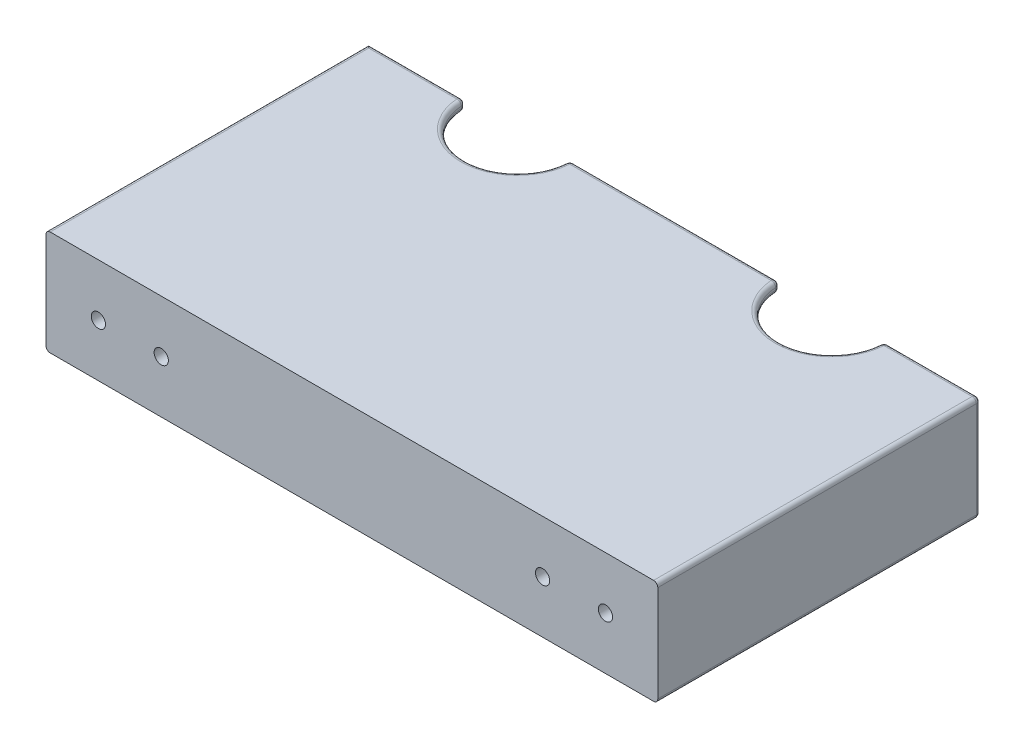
ISO-10303-21;
HEADER;
FILE_DESCRIPTION(('STEP AP214'),'2;1');
FILE_NAME('part.step','',(''),(''),'','','');
FILE_SCHEMA(('AUTOMOTIVE_DESIGN { 1 0 10303 214 1 1 1 1 }'));
ENDSEC;
DATA;
#1=APPLICATION_CONTEXT('core data for automotive mechanical design processes');
#2=APPLICATION_PROTOCOL_DEFINITION('international standard','automotive_design',2000,#1);
#3=PRODUCT_CONTEXT('',#1,'mechanical');
#4=PRODUCT('Part','Part','',(#3));
#5=PRODUCT_RELATED_PRODUCT_CATEGORY('part','',(#4));
#6=PRODUCT_DEFINITION_FORMATION('','',#4);
#7=PRODUCT_DEFINITION_CONTEXT('part definition',#1,'design');
#8=PRODUCT_DEFINITION('design','',#6,#7);
#9=PRODUCT_DEFINITION_SHAPE('','',#8);
#10=(LENGTH_UNIT() NAMED_UNIT(*) SI_UNIT(.MILLI.,.METRE.));
#11=(NAMED_UNIT(*) PLANE_ANGLE_UNIT() SI_UNIT($,.RADIAN.));
#12=(NAMED_UNIT(*) SI_UNIT($,.STERADIAN.) SOLID_ANGLE_UNIT());
#13=UNCERTAINTY_MEASURE_WITH_UNIT(LENGTH_MEASURE(1.E-05),#10,'distance_accuracy_value','');
#14=(GEOMETRIC_REPRESENTATION_CONTEXT(3) GLOBAL_UNCERTAINTY_ASSIGNED_CONTEXT((#13)) GLOBAL_UNIT_ASSIGNED_CONTEXT((#10,
#11,#12)) REPRESENTATION_CONTEXT('',''));
#15=CARTESIAN_POINT('',(0.,0.,0.));
#16=DIRECTION('',(0.,0.,1.));
#17=DIRECTION('',(1.,0.,0.));
#18=AXIS2_PLACEMENT_3D('',#15,#16,#17);
#19=CARTESIAN_POINT('',(-73.,12.5,-38.5));
#20=DIRECTION('',(0.,0.,1.));
#21=DIRECTION('',(1.,0.,0.));
#22=AXIS2_PLACEMENT_3D('',#19,#20,#21);
#23=PLANE('',#22);
#24=DIRECTION('',(1.,0.,0.));
#25=VECTOR('',#24,1.);
#26=CARTESIAN_POINT('',(-73.,11.,-38.5));
#27=LINE('',#26,#25);
#28=CARTESIAN_POINT('',(24.0370879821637,11.,-38.5));
#29=VERTEX_POINT('',#28);
#30=CARTESIAN_POINT('',(-24.0370879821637,11.,-38.5));
#31=VERTEX_POINT('',#30);
#32=EDGE_CURVE('E449',#29,#31,#27,.F.);
#33=ORIENTED_EDGE('',*,*,#32,.T.);
#34=DIRECTION('',(0.,1.,0.));
#35=VECTOR('',#34,1.);
#36=CARTESIAN_POINT('',(-24.0370879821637,12.5,-38.5));
#37=LINE('',#36,#35);
#38=CARTESIAN_POINT('',(-24.0370879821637,11.5,-38.5));
#39=VERTEX_POINT('',#38);
#40=EDGE_CURVE('E692',#31,#39,#37,.T.);
#41=ORIENTED_EDGE('',*,*,#40,.T.);
#42=DIRECTION('',(-1.,0.,0.));
#43=VECTOR('',#42,1.);
#44=CARTESIAN_POINT('',(73.,11.5,-38.5));
#45=LINE('',#44,#43);
#46=CARTESIAN_POINT('',(24.0370879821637,11.5,-38.5));
#47=VERTEX_POINT('',#46);
#48=EDGE_CURVE('E415',#39,#47,#45,.F.);
#49=ORIENTED_EDGE('',*,*,#48,.T.);
#50=DIRECTION('',(0.,1.,0.));
#51=VECTOR('',#50,1.);
#52=CARTESIAN_POINT('',(24.0370879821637,12.5,-38.5));
#53=LINE('',#52,#51);
#54=EDGE_CURVE('E690',#47,#29,#53,.F.);
#55=ORIENTED_EDGE('',*,*,#54,.T.);
#56=EDGE_LOOP('',(#33,#41,#49,#55));
#57=FACE_BOUND('',#56,.T.);
#58=ADVANCED_FACE('F37',(#57),#23,.F.);
#59=DIRECTION('',(-1.,0.,0.));
#60=VECTOR('',#59,1.);
#61=CARTESIAN_POINT('',(-73.,-11.5,-38.5));
#62=LINE('',#61,#60);
#63=CARTESIAN_POINT('',(24.0370879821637,-11.5,-38.5));
#64=VERTEX_POINT('',#63);
#65=CARTESIAN_POINT('',(-24.0370879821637,-11.5,-38.5));
#66=VERTEX_POINT('',#65);
#67=EDGE_CURVE('E431',#64,#66,#62,.T.);
#68=ORIENTED_EDGE('',*,*,#67,.T.);
#69=DIRECTION('',(0.,1.,0.));
#70=VECTOR('',#69,1.);
#71=CARTESIAN_POINT('',(-24.0370879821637,12.5,-38.5));
#72=LINE('',#71,#70);
#73=CARTESIAN_POINT('',(-24.0370879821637,-11.,-38.5));
#74=VERTEX_POINT('',#73);
#75=EDGE_CURVE('E665',#66,#74,#72,.T.);
#76=ORIENTED_EDGE('',*,*,#75,.T.);
#77=DIRECTION('',(-1.,0.,0.));
#78=VECTOR('',#77,1.);
#79=CARTESIAN_POINT('',(-73.,-11.,-38.5));
#80=LINE('',#79,#78);
#81=CARTESIAN_POINT('',(24.0370879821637,-11.,-38.5));
#82=VERTEX_POINT('',#81);
#83=EDGE_CURVE('E444',#74,#82,#80,.F.);
#84=ORIENTED_EDGE('',*,*,#83,.T.);
#85=DIRECTION('',(0.,1.,0.));
#86=VECTOR('',#85,1.);
#87=CARTESIAN_POINT('',(24.0370879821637,12.5,-38.5));
#88=LINE('',#87,#86);
#89=EDGE_CURVE('E663',#82,#64,#88,.F.);
#90=ORIENTED_EDGE('',*,*,#89,.T.);
#91=EDGE_LOOP('',(#68,#76,#84,#90));
#92=FACE_BOUND('',#91,.T.);
#93=ADVANCED_FACE('F844',(#92),#23,.F.);
#94=CARTESIAN_POINT('',(69.5,11.,-38.5));
#95=VERTEX_POINT('',#94);
#96=CARTESIAN_POINT('',(50.9629120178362,11.,-38.5));
#97=VERTEX_POINT('',#96);
#98=EDGE_CURVE('E445',#95,#97,#27,.F.);
#99=ORIENTED_EDGE('',*,*,#98,.T.);
#100=DIRECTION('',(0.,1.,0.));
#101=VECTOR('',#100,1.);
#102=CARTESIAN_POINT('',(50.9629120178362,12.5,-38.5));
#103=LINE('',#102,#101);
#104=CARTESIAN_POINT('',(50.9629120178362,11.5,-38.5));
#105=VERTEX_POINT('',#104);
#106=EDGE_CURVE('E719',#97,#105,#103,.T.);
#107=ORIENTED_EDGE('',*,*,#106,.T.);
#108=CARTESIAN_POINT('',(72.,11.5,-38.5));
#109=VERTEX_POINT('',#108);
#110=EDGE_CURVE('E412',#105,#109,#45,.F.);
#111=ORIENTED_EDGE('',*,*,#110,.T.);
#112=DIRECTION('',(0.,-1.,0.));
#113=VECTOR('',#112,1.);
#114=CARTESIAN_POINT('',(72.,12.5,-38.5));
#115=LINE('',#114,#113);
#116=CARTESIAN_POINT('',(72.,-11.5,-38.5));
#117=VERTEX_POINT('',#116);
#118=EDGE_CURVE('E424',#109,#117,#115,.T.);
#119=ORIENTED_EDGE('',*,*,#118,.T.);
#120=CARTESIAN_POINT('',(50.9629120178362,-11.5,-38.5));
#121=VERTEX_POINT('',#120);
#122=EDGE_CURVE('E427',#117,#121,#62,.T.);
#123=ORIENTED_EDGE('',*,*,#122,.T.);
#124=DIRECTION('',(0.,1.,0.));
#125=VECTOR('',#124,1.);
#126=CARTESIAN_POINT('',(50.9629120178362,12.5,-38.5));
#127=LINE('',#126,#125);
#128=CARTESIAN_POINT('',(50.9629120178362,-11.,-38.5));
#129=VERTEX_POINT('',#128);
#130=EDGE_CURVE('E717',#121,#129,#127,.T.);
#131=ORIENTED_EDGE('',*,*,#130,.T.);
#132=CARTESIAN_POINT('',(69.5,-11.,-38.5));
#133=VERTEX_POINT('',#132);
#134=EDGE_CURVE('E439',#129,#133,#80,.F.);
#135=ORIENTED_EDGE('',*,*,#134,.T.);
#136=CARTESIAN_POINT('',(69.5,-9.,-38.5));
#137=DIRECTION('',(0.,0.,1.));
#138=DIRECTION('',(1.,0.,0.));
#139=AXIS2_PLACEMENT_3D('',#136,#137,#138);
#140=CIRCLE('',#139,2.);
#141=CARTESIAN_POINT('',(71.5,-9.,-38.5));
#142=VERTEX_POINT('',#141);
#143=EDGE_CURVE('E436',#142,#133,#140,.F.);
#144=ORIENTED_EDGE('',*,*,#143,.F.);
#145=DIRECTION('',(0.,-1.,0.));
#146=VECTOR('',#145,1.);
#147=CARTESIAN_POINT('',(71.5,12.5,-38.5));
#148=LINE('',#147,#146);
#149=CARTESIAN_POINT('',(71.5,9.,-38.5));
#150=VERTEX_POINT('',#149);
#151=EDGE_CURVE('E434',#142,#150,#148,.F.);
#152=ORIENTED_EDGE('',*,*,#151,.T.);
#153=CARTESIAN_POINT('',(69.5,9.,-38.5));
#154=DIRECTION('',(0.,0.,1.));
#155=DIRECTION('',(1.,0.,0.));
#156=AXIS2_PLACEMENT_3D('',#153,#154,#155);
#157=CIRCLE('',#156,2.);
#158=EDGE_CURVE('E430',#95,#150,#157,.F.);
#159=ORIENTED_EDGE('',*,*,#158,.F.);
#160=EDGE_LOOP('',(#99,#107,#111,#119,#123,#131,#135,#144,#152,#159));
#161=FACE_BOUND('',#160,.T.);
#162=ADVANCED_FACE('F833',(#161),#23,.F.);
#163=CARTESIAN_POINT('',(70.5,-11.,-37.5));
#164=DIRECTION('',(-1.,0.,0.));
#165=DIRECTION('',(0.,0.,1.));
#166=AXIS2_PLACEMENT_3D('',#163,#164,#165);
#167=CYLINDRICAL_SURFACE('',#166,1.);
#168=ORIENTED_EDGE('',*,*,#83,.F.);
#169=CARTESIAN_POINT('',(-24.0370879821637,-11.,-37.5));
#170=DIRECTION('',(-1.,0.,0.));
#171=DIRECTION('',(0.,0.,1.));
#172=AXIS2_PLACEMENT_3D('',#169,#170,#171);
#173=CIRCLE('',#172,1.);
#174=CARTESIAN_POINT('',(-24.0370879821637,-10.,-37.5));
#175=VERTEX_POINT('',#174);
#176=EDGE_CURVE('E669',#74,#175,#173,.F.);
#177=ORIENTED_EDGE('',*,*,#176,.T.);
#178=DIRECTION('',(-1.,0.,0.));
#179=VECTOR('',#178,1.);
#180=CARTESIAN_POINT('',(70.5,-10.,-37.5));
#181=LINE('',#180,#179);
#182=CARTESIAN_POINT('',(24.0370879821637,-10.,-37.5));
#183=VERTEX_POINT('',#182);
#184=EDGE_CURVE('E464',#183,#175,#181,.T.);
#185=ORIENTED_EDGE('',*,*,#184,.F.);
#186=CARTESIAN_POINT('',(24.0370879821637,-11.,-37.5));
#187=DIRECTION('',(-1.,0.,0.));
#188=DIRECTION('',(0.,0.,1.));
#189=AXIS2_PLACEMENT_3D('',#186,#187,#188);
#190=CIRCLE('',#189,1.);
#191=EDGE_CURVE('E667',#183,#82,#190,.T.);
#192=ORIENTED_EDGE('',*,*,#191,.T.);
#193=EDGE_LOOP('',(#168,#177,#185,#192));
#194=FACE_BOUND('',#193,.T.);
#195=ADVANCED_FACE('F923',(#194),#167,.T.);
#196=ORIENTED_EDGE('',*,*,#134,.F.);
#197=CARTESIAN_POINT('',(50.9629120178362,-11.,-37.5));
#198=DIRECTION('',(-1.,0.,0.));
#199=DIRECTION('',(0.,0.,1.));
#200=AXIS2_PLACEMENT_3D('',#197,#198,#199);
#201=CIRCLE('',#200,1.);
#202=CARTESIAN_POINT('',(50.9629120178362,-10.,-37.5));
#203=VERTEX_POINT('',#202);
#204=EDGE_CURVE('E11',#129,#203,#201,.F.);
#205=ORIENTED_EDGE('',*,*,#204,.T.);
#206=CARTESIAN_POINT('',(69.5,-10.,-37.5));
#207=VERTEX_POINT('',#206);
#208=EDGE_CURVE('E460',#207,#203,#181,.T.);
#209=ORIENTED_EDGE('',*,*,#208,.F.);
#210=CARTESIAN_POINT('',(69.5,-11.,-37.5));
#211=DIRECTION('',(1.,0.,0.));
#212=DIRECTION('',(0.,0.,-1.));
#213=AXIS2_PLACEMENT_3D('',#210,#211,#212);
#214=CIRCLE('',#213,1.);
#215=EDGE_CURVE('E543',#133,#207,#214,.T.);
#216=ORIENTED_EDGE('',*,*,#215,.F.);
#217=EDGE_LOOP('',(#196,#205,#209,#216));
#218=FACE_BOUND('',#217,.T.);
#219=ADVANCED_FACE('F837',(#218),#167,.T.);
#220=CARTESIAN_POINT('',(70.5,11.,-37.5));
#221=DIRECTION('',(1.,0.,0.));
#222=DIRECTION('',(0.,0.,-1.));
#223=AXIS2_PLACEMENT_3D('',#220,#221,#222);
#224=CYLINDRICAL_SURFACE('',#223,1.);
#225=CARTESIAN_POINT('',(-50.9629120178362,11.,-38.5));
#226=VERTEX_POINT('',#225);
#227=CARTESIAN_POINT('',(-69.5,11.,-38.5));
#228=VERTEX_POINT('',#227);
#229=EDGE_CURVE('E443',#226,#228,#27,.F.);
#230=ORIENTED_EDGE('',*,*,#229,.F.);
#231=CARTESIAN_POINT('',(-50.9629120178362,11.,-37.5));
#232=DIRECTION('',(1.,0.,0.));
#233=DIRECTION('',(0.,0.,-1.));
#234=AXIS2_PLACEMENT_3D('',#231,#232,#233);
#235=CIRCLE('',#234,1.);
#236=CARTESIAN_POINT('',(-50.9629120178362,10.,-37.5));
#237=VERTEX_POINT('',#236);
#238=EDGE_CURVE('E704',#226,#237,#235,.F.);
#239=ORIENTED_EDGE('',*,*,#238,.T.);
#240=DIRECTION('',(1.,0.,0.));
#241=VECTOR('',#240,1.);
#242=CARTESIAN_POINT('',(70.5,10.,-37.5));
#243=LINE('',#242,#241);
#244=CARTESIAN_POINT('',(-69.5,10.,-37.5));
#245=VERTEX_POINT('',#244);
#246=EDGE_CURVE('E413',#245,#237,#243,.T.);
#247=ORIENTED_EDGE('',*,*,#246,.F.);
#248=CARTESIAN_POINT('',(-69.5,11.,-37.5));
#249=DIRECTION('',(-1.,0.,0.));
#250=DIRECTION('',(0.,0.,1.));
#251=AXIS2_PLACEMENT_3D('',#248,#249,#250);
#252=CIRCLE('',#251,1.);
#253=EDGE_CURVE('E523',#245,#228,#252,.F.);
#254=ORIENTED_EDGE('',*,*,#253,.T.);
#255=EDGE_LOOP('',(#230,#239,#247,#254));
#256=FACE_BOUND('',#255,.T.);
#257=ADVANCED_FACE('F932',(#256),#224,.T.);
#258=CARTESIAN_POINT('',(-24.0370879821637,10.,-37.5));
#259=VERTEX_POINT('',#258);
#260=CARTESIAN_POINT('',(24.0370879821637,10.,-37.5));
#261=VERTEX_POINT('',#260);
#262=EDGE_CURVE('E418',#259,#261,#243,.T.);
#263=ORIENTED_EDGE('',*,*,#262,.F.);
#264=CARTESIAN_POINT('',(-24.0370879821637,11.,-37.5));
#265=DIRECTION('',(1.,0.,0.));
#266=DIRECTION('',(0.,0.,-1.));
#267=AXIS2_PLACEMENT_3D('',#264,#265,#266);
#268=CIRCLE('',#267,1.);
#269=EDGE_CURVE('E688',#259,#31,#268,.T.);
#270=ORIENTED_EDGE('',*,*,#269,.T.);
#271=ORIENTED_EDGE('',*,*,#32,.F.);
#272=CARTESIAN_POINT('',(24.0370879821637,11.,-37.5));
#273=DIRECTION('',(1.,0.,0.));
#274=DIRECTION('',(0.,0.,-1.));
#275=AXIS2_PLACEMENT_3D('',#272,#273,#274);
#276=CIRCLE('',#275,1.);
#277=EDGE_CURVE('E686',#29,#261,#276,.F.);
#278=ORIENTED_EDGE('',*,*,#277,.T.);
#279=EDGE_LOOP('',(#263,#270,#271,#278));
#280=FACE_BOUND('',#279,.T.);
#281=ADVANCED_FACE('F1032',(#280),#224,.T.);
#282=CARTESIAN_POINT('',(0.,11.5,-37.5));
#283=DIRECTION('',(1.,0.,0.));
#284=DIRECTION('',(0.,0.,-1.));
#285=AXIS2_PLACEMENT_3D('',#282,#283,#284);
#286=CYLINDRICAL_SURFACE('',#285,1.);
#287=ORIENTED_EDGE('',*,*,#48,.F.);
#288=CARTESIAN_POINT('',(-24.0370879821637,11.5,-37.5));
#289=DIRECTION('',(1.,0.,0.));
#290=DIRECTION('',(0.,0.,-1.));
#291=AXIS2_PLACEMENT_3D('',#288,#289,#290);
#292=CIRCLE('',#291,1.);
#293=CARTESIAN_POINT('',(-24.0370879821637,12.5,-37.5));
#294=VERTEX_POINT('',#293);
#295=EDGE_CURVE('E696',#39,#294,#292,.T.);
#296=ORIENTED_EDGE('',*,*,#295,.T.);
#297=DIRECTION('',(-1.,0.,0.));
#298=VECTOR('',#297,1.);
#299=CARTESIAN_POINT('',(-73.,12.5,-37.5));
#300=LINE('',#299,#298);
#301=CARTESIAN_POINT('',(24.0370879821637,12.5,-37.5));
#302=VERTEX_POINT('',#301);
#303=EDGE_CURVE('E513',#302,#294,#300,.T.);
#304=ORIENTED_EDGE('',*,*,#303,.F.);
#305=CARTESIAN_POINT('',(24.0370879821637,11.5,-37.5));
#306=DIRECTION('',(1.,0.,0.));
#307=DIRECTION('',(0.,0.,-1.));
#308=AXIS2_PLACEMENT_3D('',#305,#306,#307);
#309=CIRCLE('',#308,1.);
#310=EDGE_CURVE('E694',#302,#47,#309,.F.);
#311=ORIENTED_EDGE('',*,*,#310,.T.);
#312=EDGE_LOOP('',(#287,#296,#304,#311));
#313=FACE_BOUND('',#312,.T.);
#314=ADVANCED_FACE('F1270',(#313),#286,.T.);
#315=ORIENTED_EDGE('',*,*,#110,.F.);
#316=CARTESIAN_POINT('',(50.9629120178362,11.5,-37.5));
#317=DIRECTION('',(1.,0.,0.));
#318=DIRECTION('',(0.,0.,-1.));
#319=AXIS2_PLACEMENT_3D('',#316,#317,#318);
#320=CIRCLE('',#319,1.);
#321=CARTESIAN_POINT('',(50.9629120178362,12.5,-37.5));
#322=VERTEX_POINT('',#321);
#323=EDGE_CURVE('E721',#105,#322,#320,.T.);
#324=ORIENTED_EDGE('',*,*,#323,.T.);
#325=CARTESIAN_POINT('',(72.,12.5,-37.5));
#326=VERTEX_POINT('',#325);
#327=EDGE_CURVE('E509',#326,#322,#300,.T.);
#328=ORIENTED_EDGE('',*,*,#327,.F.);
#329=CARTESIAN_POINT('',(72.,11.5,-37.5));
#330=DIRECTION('',(1.,0.,0.));
#331=DIRECTION('',(0.,0.,-1.));
#332=AXIS2_PLACEMENT_3D('',#329,#330,#331);
#333=CIRCLE('',#332,1.);
#334=EDGE_CURVE('E577',#109,#326,#333,.T.);
#335=ORIENTED_EDGE('',*,*,#334,.F.);
#336=EDGE_LOOP('',(#315,#324,#328,#335));
#337=FACE_BOUND('',#336,.T.);
#338=ADVANCED_FACE('F901',(#337),#286,.T.);
#339=CARTESIAN_POINT('',(-73.,-11.5,-37.5));
#340=DIRECTION('',(-1.,0.,0.));
#341=DIRECTION('',(0.,0.,1.));
#342=AXIS2_PLACEMENT_3D('',#339,#340,#341);
#343=CYLINDRICAL_SURFACE('',#342,1.);
#344=CARTESIAN_POINT('',(-50.9629120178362,-11.5,-38.5));
#345=VERTEX_POINT('',#344);
#346=CARTESIAN_POINT('',(-73.,-11.5,-38.5));
#347=VERTEX_POINT('',#346);
#348=EDGE_CURVE('E426',#345,#347,#62,.T.);
#349=ORIENTED_EDGE('',*,*,#348,.F.);
#350=CARTESIAN_POINT('',(-50.9629120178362,-11.5,-37.5));
#351=DIRECTION('',(-1.,0.,0.));
#352=DIRECTION('',(0.,0.,1.));
#353=AXIS2_PLACEMENT_3D('',#350,#351,#352);
#354=CIRCLE('',#353,1.);
#355=CARTESIAN_POINT('',(-50.9629120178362,-12.5,-37.5));
#356=VERTEX_POINT('',#355);
#357=EDGE_CURVE('E653',#345,#356,#354,.T.);
#358=ORIENTED_EDGE('',*,*,#357,.T.);
#359=DIRECTION('',(-1.,0.,0.));
#360=VECTOR('',#359,1.);
#361=CARTESIAN_POINT('',(0.,-12.5,-37.5));
#362=LINE('',#361,#360);
#363=CARTESIAN_POINT('',(-72.,-12.5,-37.5));
#364=VERTEX_POINT('',#363);
#365=EDGE_CURVE('E486',#364,#356,#362,.F.);
#366=ORIENTED_EDGE('',*,*,#365,.F.);
#367=CARTESIAN_POINT('',(-72.,-11.5,-37.5));
#368=DIRECTION('',(-0.707106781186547,0.,0.707106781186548));
#369=DIRECTION('',(0.707106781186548,0.,0.707106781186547));
#370=AXIS2_PLACEMENT_3D('',#367,#368,#369);
#371=ELLIPSE('',#370,1.4142135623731,1.);
#372=EDGE_CURVE('E561',#364,#347,#371,.F.);
#373=ORIENTED_EDGE('',*,*,#372,.T.);
#374=EDGE_LOOP('',(#349,#358,#366,#373));
#375=FACE_BOUND('',#374,.T.);
#376=ADVANCED_FACE('F889',(#375),#343,.T.);
#377=CARTESIAN_POINT('',(-24.0370879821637,-12.5,-37.5));
#378=VERTEX_POINT('',#377);
#379=CARTESIAN_POINT('',(24.0370879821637,-12.5,-37.5));
#380=VERTEX_POINT('',#379);
#381=EDGE_CURVE('E490',#378,#380,#362,.F.);
#382=ORIENTED_EDGE('',*,*,#381,.F.);
#383=CARTESIAN_POINT('',(-24.0370879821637,-11.5,-37.5));
#384=DIRECTION('',(-1.,0.,0.));
#385=DIRECTION('',(0.,0.,1.));
#386=AXIS2_PLACEMENT_3D('',#383,#384,#385);
#387=CIRCLE('',#386,1.);
#388=EDGE_CURVE('E661',#378,#66,#387,.F.);
#389=ORIENTED_EDGE('',*,*,#388,.T.);
#390=ORIENTED_EDGE('',*,*,#67,.F.);
#391=CARTESIAN_POINT('',(24.0370879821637,-11.5,-37.5));
#392=DIRECTION('',(-1.,0.,0.));
#393=DIRECTION('',(0.,0.,1.));
#394=AXIS2_PLACEMENT_3D('',#391,#392,#393);
#395=CIRCLE('',#394,1.);
#396=EDGE_CURVE('E659',#64,#380,#395,.T.);
#397=ORIENTED_EDGE('',*,*,#396,.T.);
#398=EDGE_LOOP('',(#382,#389,#390,#397));
#399=FACE_BOUND('',#398,.T.);
#400=ADVANCED_FACE('F865',(#399),#343,.T.);
#401=CARTESIAN_POINT('',(-69.5,-11.,-38.5));
#402=VERTEX_POINT('',#401);
#403=CARTESIAN_POINT('',(-50.9629120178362,-11.,-38.5));
#404=VERTEX_POINT('',#403);
#405=EDGE_CURVE('E440',#402,#404,#80,.F.);
#406=ORIENTED_EDGE('',*,*,#405,.T.);
#407=DIRECTION('',(0.,1.,0.));
#408=VECTOR('',#407,1.);
#409=CARTESIAN_POINT('',(-50.9629120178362,12.5,-38.5));
#410=LINE('',#409,#408);
#411=EDGE_CURVE('E651',#404,#345,#410,.F.);
#412=ORIENTED_EDGE('',*,*,#411,.T.);
#413=ORIENTED_EDGE('',*,*,#348,.T.);
#414=DIRECTION('',(0.,-1.,0.));
#415=VECTOR('',#414,1.);
#416=CARTESIAN_POINT('',(-73.,12.5,-38.5));
#417=LINE('',#416,#415);
#418=CARTESIAN_POINT('',(-73.,11.5,-38.5));
#419=VERTEX_POINT('',#418);
#420=EDGE_CURVE('E1035',#419,#347,#417,.T.);
#421=ORIENTED_EDGE('',*,*,#420,.F.);
#422=CARTESIAN_POINT('',(-50.9629120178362,11.5,-38.5));
#423=VERTEX_POINT('',#422);
#424=EDGE_CURVE('E417',#419,#423,#45,.F.);
#425=ORIENTED_EDGE('',*,*,#424,.T.);
#426=DIRECTION('',(0.,1.,0.));
#427=VECTOR('',#426,1.);
#428=CARTESIAN_POINT('',(-50.9629120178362,12.5,-38.5));
#429=LINE('',#428,#427);
#430=EDGE_CURVE('E649',#423,#226,#429,.F.);
#431=ORIENTED_EDGE('',*,*,#430,.T.);
#432=ORIENTED_EDGE('',*,*,#229,.T.);
#433=CARTESIAN_POINT('',(-69.5,9.,-38.5));
#434=DIRECTION('',(0.,0.,1.));
#435=DIRECTION('',(1.,0.,0.));
#436=AXIS2_PLACEMENT_3D('',#433,#434,#435);
#437=CIRCLE('',#436,2.);
#438=CARTESIAN_POINT('',(-71.5,9.,-38.5));
#439=VERTEX_POINT('',#438);
#440=EDGE_CURVE('E454',#439,#228,#437,.F.);
#441=ORIENTED_EDGE('',*,*,#440,.F.);
#442=DIRECTION('',(0.,1.,0.));
#443=VECTOR('',#442,1.);
#444=CARTESIAN_POINT('',(-71.5,12.5,-38.5));
#445=LINE('',#444,#443);
#446=CARTESIAN_POINT('',(-71.5,-9.,-38.5));
#447=VERTEX_POINT('',#446);
#448=EDGE_CURVE('E452',#439,#447,#445,.F.);
#449=ORIENTED_EDGE('',*,*,#448,.T.);
#450=CARTESIAN_POINT('',(-69.5,-9.,-38.5));
#451=DIRECTION('',(0.,0.,1.));
#452=DIRECTION('',(1.,0.,0.));
#453=AXIS2_PLACEMENT_3D('',#450,#451,#452);
#454=CIRCLE('',#453,2.);
#455=EDGE_CURVE('E448',#402,#447,#454,.F.);
#456=ORIENTED_EDGE('',*,*,#455,.F.);
#457=EDGE_LOOP('',(#406,#412,#413,#421,#425,#431,#432,#441,#449,#456));
#458=FACE_BOUND('',#457,.T.);
#459=ADVANCED_FACE('F904',(#458),#23,.F.);
#460=CARTESIAN_POINT('',(73.,12.5,-38.5));
#461=DIRECTION('',(-1.,0.,0.));
#462=DIRECTION('',(0.,0.,1.));
#463=AXIS2_PLACEMENT_3D('',#460,#461,#462);
#464=PLANE('',#463);
#465=DIRECTION('',(0.,-1.,0.));
#466=VECTOR('',#465,1.);
#467=CARTESIAN_POINT('',(73.,12.5,38.5));
#468=LINE('',#467,#466);
#469=CARTESIAN_POINT('',(73.,11.5,38.5));
#470=VERTEX_POINT('',#469);
#471=CARTESIAN_POINT('',(73.,-11.5,38.5));
#472=VERTEX_POINT('',#471);
#473=EDGE_CURVE('E1060',#470,#472,#468,.T.);
#474=ORIENTED_EDGE('',*,*,#473,.T.);
#475=DIRECTION('',(0.,0.,-1.));
#476=VECTOR('',#475,1.);
#477=CARTESIAN_POINT('',(73.,-11.5,-38.5));
#478=LINE('',#477,#476);
#479=CARTESIAN_POINT('',(73.,-11.5,-37.5));
#480=VERTEX_POINT('',#479);
#481=EDGE_CURVE('E496',#472,#480,#478,.T.);
#482=ORIENTED_EDGE('',*,*,#481,.T.);
#483=DIRECTION('',(0.,-1.,0.));
#484=VECTOR('',#483,1.);
#485=CARTESIAN_POINT('',(73.,12.5,-37.5));
#486=LINE('',#485,#484);
#487=CARTESIAN_POINT('',(73.,11.5,-37.5));
#488=VERTEX_POINT('',#487);
#489=EDGE_CURVE('E492',#480,#488,#486,.F.);
#490=ORIENTED_EDGE('',*,*,#489,.T.);
#491=DIRECTION('',(0.,0.,-1.));
#492=VECTOR('',#491,1.);
#493=CARTESIAN_POINT('',(73.,11.5,38.5));
#494=LINE('',#493,#492);
#495=EDGE_CURVE('E494',#488,#470,#494,.F.);
#496=ORIENTED_EDGE('',*,*,#495,.T.);
#497=EDGE_LOOP('',(#474,#482,#490,#496));
#498=FACE_BOUND('',#497,.T.);
#499=ADVANCED_FACE('F915',(#498),#464,.F.);
#500=CARTESIAN_POINT('',(-73.,12.5,-38.5));
#501=DIRECTION('',(1.,0.,0.));
#502=DIRECTION('',(0.,0.,-1.));
#503=AXIS2_PLACEMENT_3D('',#500,#501,#502);
#504=PLANE('',#503);
#505=DIRECTION('',(0.,0.,-1.));
#506=VECTOR('',#505,1.);
#507=CARTESIAN_POINT('',(-73.,5.,-30.5));
#508=LINE('',#507,#506);
#509=CARTESIAN_POINT('',(-73.,5.,29.5));
#510=VERTEX_POINT('',#509);
#511=CARTESIAN_POINT('',(-73.,5.,-29.5));
#512=VERTEX_POINT('',#511);
#513=EDGE_CURVE('E1090',#510,#512,#508,.T.);
#514=ORIENTED_EDGE('',*,*,#513,.F.);
#515=CARTESIAN_POINT('',(-73.,4.,29.5));
#516=DIRECTION('',(1.,0.,0.));
#517=DIRECTION('',(0.,0.,-1.));
#518=AXIS2_PLACEMENT_3D('',#515,#516,#517);
#519=CIRCLE('',#518,1.);
#520=CARTESIAN_POINT('',(-73.,4.,30.5));
#521=VERTEX_POINT('',#520);
#522=EDGE_CURVE('E620',#510,#521,#519,.T.);
#523=ORIENTED_EDGE('',*,*,#522,.T.);
#524=DIRECTION('',(0.,1.,0.));
#525=VECTOR('',#524,1.);
#526=CARTESIAN_POINT('',(-73.,-5.,30.5));
#527=LINE('',#526,#525);
#528=CARTESIAN_POINT('',(-73.,-4.,30.5));
#529=VERTEX_POINT('',#528);
#530=EDGE_CURVE('E753',#529,#521,#527,.T.);
#531=ORIENTED_EDGE('',*,*,#530,.F.);
#532=CARTESIAN_POINT('',(-73.,-4.,29.5));
#533=DIRECTION('',(1.,0.,0.));
#534=DIRECTION('',(0.,0.,-1.));
#535=AXIS2_PLACEMENT_3D('',#532,#533,#534);
#536=CIRCLE('',#535,1.);
#537=CARTESIAN_POINT('',(-73.,-5.,29.5));
#538=VERTEX_POINT('',#537);
#539=EDGE_CURVE('E616',#529,#538,#536,.T.);
#540=ORIENTED_EDGE('',*,*,#539,.T.);
#541=DIRECTION('',(0.,0.,1.));
#542=VECTOR('',#541,1.);
#543=CARTESIAN_POINT('',(-73.,-5.,-30.5));
#544=LINE('',#543,#542);
#545=CARTESIAN_POINT('',(-73.,-5.,-29.5));
#546=VERTEX_POINT('',#545);
#547=EDGE_CURVE('E565',#546,#538,#544,.T.);
#548=ORIENTED_EDGE('',*,*,#547,.F.);
#549=CARTESIAN_POINT('',(-73.,-4.,-29.5));
#550=DIRECTION('',(1.,0.,0.));
#551=DIRECTION('',(0.,0.,-1.));
#552=AXIS2_PLACEMENT_3D('',#549,#550,#551);
#553=CIRCLE('',#552,1.);
#554=CARTESIAN_POINT('',(-73.,-4.,-30.5));
#555=VERTEX_POINT('',#554);
#556=EDGE_CURVE('E624',#546,#555,#553,.T.);
#557=ORIENTED_EDGE('',*,*,#556,.T.);
#558=DIRECTION('',(0.,-1.,0.));
#559=VECTOR('',#558,1.);
#560=CARTESIAN_POINT('',(-73.,-5.,-30.5));
#561=LINE('',#560,#559);
#562=CARTESIAN_POINT('',(-73.,4.,-30.5));
#563=VERTEX_POINT('',#562);
#564=EDGE_CURVE('E1087',#563,#555,#561,.T.);
#565=ORIENTED_EDGE('',*,*,#564,.F.);
#566=CARTESIAN_POINT('',(-73.,4.,-29.5));
#567=DIRECTION('',(1.,0.,0.));
#568=DIRECTION('',(0.,0.,-1.));
#569=AXIS2_PLACEMENT_3D('',#566,#567,#568);
#570=CIRCLE('',#569,1.);
#571=EDGE_CURVE('E628',#563,#512,#570,.T.);
#572=ORIENTED_EDGE('',*,*,#571,.T.);
#573=EDGE_LOOP('',(#514,#523,#531,#540,#548,#557,#565,#572));
#574=FACE_BOUND('',#573,.T.);
#575=ORIENTED_EDGE('',*,*,#420,.T.);
#576=DIRECTION('',(0.,0.,1.));
#577=VECTOR('',#576,1.);
#578=CARTESIAN_POINT('',(-73.,-11.5,-38.5));
#579=LINE('',#578,#577);
#580=CARTESIAN_POINT('',(-73.,-11.5,38.5));
#581=VERTEX_POINT('',#580);
#582=EDGE_CURVE('E517',#347,#581,#579,.T.);
#583=ORIENTED_EDGE('',*,*,#582,.T.);
#584=DIRECTION('',(0.,-1.,0.));
#585=VECTOR('',#584,1.);
#586=CARTESIAN_POINT('',(-73.,12.5,38.5));
#587=LINE('',#586,#585);
#588=CARTESIAN_POINT('',(-73.,11.5,38.5));
#589=VERTEX_POINT('',#588);
#590=EDGE_CURVE('E1037',#589,#581,#587,.T.);
#591=ORIENTED_EDGE('',*,*,#590,.F.);
#592=DIRECTION('',(0.,0.,1.));
#593=VECTOR('',#592,1.);
#594=CARTESIAN_POINT('',(-73.,11.5,-38.5));
#595=LINE('',#594,#593);
#596=EDGE_CURVE('E515',#589,#419,#595,.F.);
#597=ORIENTED_EDGE('',*,*,#596,.T.);
#598=EDGE_LOOP('',(#575,#583,#591,#597));
#599=FACE_BOUND('',#598,.T.);
#600=ADVANCED_FACE('F920',(#574,#599),#504,.F.);
#601=CARTESIAN_POINT('',(-73.,12.5,38.5));
#602=DIRECTION('',(0.,0.,-1.));
#603=DIRECTION('',(-1.,0.,0.));
#604=AXIS2_PLACEMENT_3D('',#601,#602,#603);
#605=PLANE('',#604);
#606=CARTESIAN_POINT('',(60.5,0.,38.5));
#607=DIRECTION('',(0.,0.,-1.));
#608=DIRECTION('',(-1.,0.,0.));
#609=AXIS2_PLACEMENT_3D('',#606,#607,#608);
#610=CIRCLE('',#609,1.7);
#611=CARTESIAN_POINT('',(58.8,0.,38.5));
#612=VERTEX_POINT('',#611);
#613=EDGE_CURVE('E1040',#612,#612,#610,.T.);
#614=ORIENTED_EDGE('',*,*,#613,.T.);
#615=EDGE_LOOP('',(#614));
#616=FACE_BOUND('',#615,.T.);
#617=CARTESIAN_POINT('',(45.5,0.,38.5));
#618=DIRECTION('',(0.,0.,-1.));
#619=DIRECTION('',(-1.,0.,0.));
#620=AXIS2_PLACEMENT_3D('',#617,#618,#619);
#621=CIRCLE('',#620,1.7);
#622=CARTESIAN_POINT('',(43.8,0.,38.5));
#623=VERTEX_POINT('',#622);
#624=EDGE_CURVE('E1045',#623,#623,#621,.T.);
#625=ORIENTED_EDGE('',*,*,#624,.T.);
#626=EDGE_LOOP('',(#625));
#627=FACE_BOUND('',#626,.T.);
#628=CARTESIAN_POINT('',(-45.5,0.,38.5));
#629=DIRECTION('',(0.,0.,-1.));
#630=DIRECTION('',(-1.,0.,0.));
#631=AXIS2_PLACEMENT_3D('',#628,#629,#630);
#632=CIRCLE('',#631,1.7);
#633=CARTESIAN_POINT('',(-47.2,0.,38.5));
#634=VERTEX_POINT('',#633);
#635=EDGE_CURVE('E1050',#634,#634,#632,.T.);
#636=ORIENTED_EDGE('',*,*,#635,.T.);
#637=EDGE_LOOP('',(#636));
#638=FACE_BOUND('',#637,.T.);
#639=CARTESIAN_POINT('',(-60.5,0.,38.5));
#640=DIRECTION('',(0.,0.,-1.));
#641=DIRECTION('',(-1.,0.,0.));
#642=AXIS2_PLACEMENT_3D('',#639,#640,#641);
#643=CIRCLE('',#642,1.7);
#644=CARTESIAN_POINT('',(-62.2,0.,38.5));
#645=VERTEX_POINT('',#644);
#646=EDGE_CURVE('E396',#645,#645,#643,.T.);
#647=ORIENTED_EDGE('',*,*,#646,.T.);
#648=EDGE_LOOP('',(#647));
#649=FACE_BOUND('',#648,.T.);
#650=DIRECTION('',(1.,0.,0.));
#651=VECTOR('',#650,1.);
#652=CARTESIAN_POINT('',(-73.,-12.5,38.5));
#653=LINE('',#652,#651);
#654=CARTESIAN_POINT('',(-72.,-12.5,38.5));
#655=VERTEX_POINT('',#654);
#656=CARTESIAN_POINT('',(72.,-12.5,38.5));
#657=VERTEX_POINT('',#656);
#658=EDGE_CURVE('E1064',#655,#657,#653,.T.);
#659=ORIENTED_EDGE('',*,*,#658,.T.);
#660=CARTESIAN_POINT('',(72.,-11.5,38.5));
#661=DIRECTION('',(0.,0.,-1.));
#662=DIRECTION('',(-1.,0.,0.));
#663=AXIS2_PLACEMENT_3D('',#660,#661,#662);
#664=CIRCLE('',#663,1.);
#665=EDGE_CURVE('E504',#657,#472,#664,.F.);
#666=ORIENTED_EDGE('',*,*,#665,.T.);
#667=ORIENTED_EDGE('',*,*,#473,.F.);
#668=CARTESIAN_POINT('',(72.,11.5,38.5));
#669=DIRECTION('',(0.,0.,-1.));
#670=DIRECTION('',(-1.,0.,0.));
#671=AXIS2_PLACEMENT_3D('',#668,#669,#670);
#672=CIRCLE('',#671,1.);
#673=CARTESIAN_POINT('',(72.,12.5,38.5));
#674=VERTEX_POINT('',#673);
#675=EDGE_CURVE('E502',#470,#674,#672,.F.);
#676=ORIENTED_EDGE('',*,*,#675,.T.);
#677=DIRECTION('',(1.,0.,0.));
#678=VECTOR('',#677,1.);
#679=CARTESIAN_POINT('',(-73.,12.5,38.5));
#680=LINE('',#679,#678);
#681=CARTESIAN_POINT('',(-72.,12.5,38.5));
#682=VERTEX_POINT('',#681);
#683=EDGE_CURVE('E1063',#682,#674,#680,.T.);
#684=ORIENTED_EDGE('',*,*,#683,.F.);
#685=CARTESIAN_POINT('',(-72.,11.5,38.5));
#686=DIRECTION('',(0.,0.,-1.));
#687=DIRECTION('',(-1.,0.,0.));
#688=AXIS2_PLACEMENT_3D('',#685,#686,#687);
#689=CIRCLE('',#688,1.);
#690=EDGE_CURVE('E498',#682,#589,#689,.F.);
#691=ORIENTED_EDGE('',*,*,#690,.T.);
#692=ORIENTED_EDGE('',*,*,#590,.T.);
#693=CARTESIAN_POINT('',(-72.,-11.5,38.5));
#694=DIRECTION('',(0.,0.,-1.));
#695=DIRECTION('',(-1.,0.,0.));
#696=AXIS2_PLACEMENT_3D('',#693,#694,#695);
#697=CIRCLE('',#696,1.);
#698=EDGE_CURVE('E500',#581,#655,#697,.F.);
#699=ORIENTED_EDGE('',*,*,#698,.T.);
#700=EDGE_LOOP('',(#659,#666,#667,#676,#684,#691,#692,#699));
#701=FACE_BOUND('',#700,.T.);
#702=ADVANCED_FACE('F1132',(#616,#627,#638,#649,#701),#605,.F.);
#703=CARTESIAN_POINT('',(0.,12.5,0.));
#704=DIRECTION('',(0.,1.,0.));
#705=DIRECTION('',(0.,0.,1.));
#706=AXIS2_PLACEMENT_3D('',#703,#704,#705);
#707=PLANE('',#706);
#708=ORIENTED_EDGE('',*,*,#303,.T.);
#709=CARTESIAN_POINT('',(-37.5,12.5,-38.5));
#710=DIRECTION('',(0.,1.,0.));
#711=DIRECTION('',(0.,0.,1.));
#712=AXIS2_PLACEMENT_3D('',#709,#710,#711);
#713=CIRCLE('',#712,13.5);
#714=CARTESIAN_POINT('',(-50.9629120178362,12.5,-37.5));
#715=VERTEX_POINT('',#714);
#716=EDGE_CURVE('E700',#294,#715,#713,.F.);
#717=ORIENTED_EDGE('',*,*,#716,.T.);
#718=CARTESIAN_POINT('',(-72.,12.5,-37.5));
#719=VERTEX_POINT('',#718);
#720=EDGE_CURVE('E508',#715,#719,#300,.T.);
#721=ORIENTED_EDGE('',*,*,#720,.T.);
#722=DIRECTION('',(0.,0.,1.));
#723=VECTOR('',#722,1.);
#724=CARTESIAN_POINT('',(-72.,12.5,38.5));
#725=LINE('',#724,#723);
#726=EDGE_CURVE('E506',#719,#682,#725,.T.);
#727=ORIENTED_EDGE('',*,*,#726,.T.);
#728=ORIENTED_EDGE('',*,*,#683,.T.);
#729=DIRECTION('',(0.,0.,-1.));
#730=VECTOR('',#729,1.);
#731=CARTESIAN_POINT('',(72.,12.5,-38.5));
#732=LINE('',#731,#730);
#733=EDGE_CURVE('E512',#674,#326,#732,.T.);
#734=ORIENTED_EDGE('',*,*,#733,.T.);
#735=ORIENTED_EDGE('',*,*,#327,.T.);
#736=CARTESIAN_POINT('',(37.5,12.5,-38.5));
#737=DIRECTION('',(0.,1.,0.));
#738=DIRECTION('',(0.,0.,1.));
#739=AXIS2_PLACEMENT_3D('',#736,#737,#738);
#740=CIRCLE('',#739,13.5);
#741=EDGE_CURVE('E698',#322,#302,#740,.F.);
#742=ORIENTED_EDGE('',*,*,#741,.T.);
#743=EDGE_LOOP('',(#708,#717,#721,#727,#728,#734,#735,#742));
#744=FACE_BOUND('',#743,.T.);
#745=ADVANCED_FACE('F1212',(#744),#707,.T.);
#746=CARTESIAN_POINT('',(0.,-12.5,0.));
#747=DIRECTION('',(0.,1.,0.));
#748=DIRECTION('',(0.,0.,1.));
#749=AXIS2_PLACEMENT_3D('',#746,#747,#748);
#750=PLANE('',#749);
#751=ORIENTED_EDGE('',*,*,#365,.T.);
#752=CARTESIAN_POINT('',(-37.5,-12.5,-38.5));
#753=DIRECTION('',(0.,1.,0.));
#754=DIRECTION('',(0.,0.,1.));
#755=AXIS2_PLACEMENT_3D('',#752,#753,#754);
#756=CIRCLE('',#755,13.5);
#757=EDGE_CURVE('E657',#356,#378,#756,.T.);
#758=ORIENTED_EDGE('',*,*,#757,.T.);
#759=ORIENTED_EDGE('',*,*,#381,.T.);
#760=CARTESIAN_POINT('',(37.5,-12.5,-38.5));
#761=DIRECTION('',(0.,1.,0.));
#762=DIRECTION('',(0.,0.,1.));
#763=AXIS2_PLACEMENT_3D('',#760,#761,#762);
#764=CIRCLE('',#763,13.5);
#765=CARTESIAN_POINT('',(50.9629120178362,-12.5,-37.5));
#766=VERTEX_POINT('',#765);
#767=EDGE_CURVE('E655',#380,#766,#764,.T.);
#768=ORIENTED_EDGE('',*,*,#767,.T.);
#769=CARTESIAN_POINT('',(72.,-12.5,-37.5));
#770=VERTEX_POINT('',#769);
#771=EDGE_CURVE('E485',#766,#770,#362,.F.);
#772=ORIENTED_EDGE('',*,*,#771,.T.);
#773=DIRECTION('',(0.,0.,-1.));
#774=VECTOR('',#773,1.);
#775=CARTESIAN_POINT('',(72.,-12.5,0.));
#776=LINE('',#775,#774);
#777=EDGE_CURVE('E489',#770,#657,#776,.F.);
#778=ORIENTED_EDGE('',*,*,#777,.T.);
#779=ORIENTED_EDGE('',*,*,#658,.F.);
#780=DIRECTION('',(0.,0.,1.));
#781=VECTOR('',#780,1.);
#782=CARTESIAN_POINT('',(-72.,-12.5,0.));
#783=LINE('',#782,#781);
#784=EDGE_CURVE('E483',#655,#364,#783,.F.);
#785=ORIENTED_EDGE('',*,*,#784,.T.);
#786=EDGE_LOOP('',(#751,#758,#759,#768,#772,#778,#779,#785));
#787=FACE_BOUND('',#786,.T.);
#788=ADVANCED_FACE('F868',(#787),#750,.F.);
#789=CARTESIAN_POINT('',(-70.5,-10.,32.5));
#790=DIRECTION('',(-1.,0.,0.));
#791=DIRECTION('',(0.,0.,1.));
#792=AXIS2_PLACEMENT_3D('',#789,#790,#791);
#793=PLANE('',#792);
#794=DIRECTION('',(0.,-1.,0.));
#795=VECTOR('',#794,1.);
#796=CARTESIAN_POINT('',(-70.5,-10.,-30.5));
#797=LINE('',#796,#795);
#798=CARTESIAN_POINT('',(-70.5,4.,-30.5));
#799=VERTEX_POINT('',#798);
#800=CARTESIAN_POINT('',(-70.5,-4.,-30.5));
#801=VERTEX_POINT('',#800);
#802=EDGE_CURVE('E587',#799,#801,#797,.T.);
#803=ORIENTED_EDGE('',*,*,#802,.T.);
#804=CARTESIAN_POINT('',(-70.5,-4.,-29.5));
#805=DIRECTION('',(-1.,0.,0.));
#806=DIRECTION('',(0.,0.,1.));
#807=AXIS2_PLACEMENT_3D('',#804,#805,#806);
#808=CIRCLE('',#807,1.);
#809=CARTESIAN_POINT('',(-70.5,-5.,-29.5));
#810=VERTEX_POINT('',#809);
#811=EDGE_CURVE('E626',#801,#810,#808,.T.);
#812=ORIENTED_EDGE('',*,*,#811,.T.);
#813=DIRECTION('',(0.,0.,1.));
#814=VECTOR('',#813,1.);
#815=CARTESIAN_POINT('',(-70.5,-5.,32.5));
#816=LINE('',#815,#814);
#817=CARTESIAN_POINT('',(-70.5,-5.,29.5));
#818=VERTEX_POINT('',#817);
#819=EDGE_CURVE('E590',#810,#818,#816,.T.);
#820=ORIENTED_EDGE('',*,*,#819,.T.);
#821=CARTESIAN_POINT('',(-70.5,-4.,29.5));
#822=DIRECTION('',(-1.,0.,0.));
#823=DIRECTION('',(0.,0.,1.));
#824=AXIS2_PLACEMENT_3D('',#821,#822,#823);
#825=CIRCLE('',#824,1.);
#826=CARTESIAN_POINT('',(-70.5,-4.,30.5));
#827=VERTEX_POINT('',#826);
#828=EDGE_CURVE('E618',#818,#827,#825,.T.);
#829=ORIENTED_EDGE('',*,*,#828,.T.);
#830=DIRECTION('',(0.,1.,0.));
#831=VECTOR('',#830,1.);
#832=CARTESIAN_POINT('',(-70.5,-10.,30.5));
#833=LINE('',#832,#831);
#834=CARTESIAN_POINT('',(-70.5,4.,30.5));
#835=VERTEX_POINT('',#834);
#836=EDGE_CURVE('E593',#827,#835,#833,.T.);
#837=ORIENTED_EDGE('',*,*,#836,.T.);
#838=CARTESIAN_POINT('',(-70.5,4.,29.5));
#839=DIRECTION('',(-1.,0.,0.));
#840=DIRECTION('',(0.,0.,1.));
#841=AXIS2_PLACEMENT_3D('',#838,#839,#840);
#842=CIRCLE('',#841,1.);
#843=CARTESIAN_POINT('',(-70.5,5.,29.5));
#844=VERTEX_POINT('',#843);
#845=EDGE_CURVE('E622',#835,#844,#842,.T.);
#846=ORIENTED_EDGE('',*,*,#845,.T.);
#847=DIRECTION('',(0.,0.,-1.));
#848=VECTOR('',#847,1.);
#849=CARTESIAN_POINT('',(-70.5,5.,32.5));
#850=LINE('',#849,#848);
#851=CARTESIAN_POINT('',(-70.5,5.,-29.5));
#852=VERTEX_POINT('',#851);
#853=EDGE_CURVE('E519',#844,#852,#850,.T.);
#854=ORIENTED_EDGE('',*,*,#853,.T.);
#855=CARTESIAN_POINT('',(-70.5,4.,-29.5));
#856=DIRECTION('',(-1.,0.,0.));
#857=DIRECTION('',(0.,0.,1.));
#858=AXIS2_PLACEMENT_3D('',#855,#856,#857);
#859=CIRCLE('',#858,1.);
#860=EDGE_CURVE('E630',#852,#799,#859,.T.);
#861=ORIENTED_EDGE('',*,*,#860,.T.);
#862=EDGE_LOOP('',(#803,#812,#820,#829,#837,#846,#854,#861));
#863=FACE_BOUND('',#862,.T.);
#864=DIRECTION('',(0.,1.,0.));
#865=VECTOR('',#864,1.);
#866=CARTESIAN_POINT('',(-70.5,-10.,31.5));
#867=LINE('',#866,#865);
#868=CARTESIAN_POINT('',(-70.5,9.,31.5));
#869=VERTEX_POINT('',#868);
#870=CARTESIAN_POINT('',(-70.5,-9.,31.5));
#871=VERTEX_POINT('',#870);
#872=EDGE_CURVE('E402',#869,#871,#867,.F.);
#873=ORIENTED_EDGE('',*,*,#872,.T.);
#874=DIRECTION('',(0.,0.,-1.));
#875=VECTOR('',#874,1.);
#876=CARTESIAN_POINT('',(-70.5,-9.,-38.5));
#877=LINE('',#876,#875);
#878=CARTESIAN_POINT('',(-70.5,-9.,-37.5));
#879=VERTEX_POINT('',#878);
#880=EDGE_CURVE('E471',#871,#879,#877,.T.);
#881=ORIENTED_EDGE('',*,*,#880,.T.);
#882=DIRECTION('',(0.,1.,0.));
#883=VECTOR('',#882,1.);
#884=CARTESIAN_POINT('',(-70.5,-10.,-37.5));
#885=LINE('',#884,#883);
#886=CARTESIAN_POINT('',(-70.5,9.,-37.5));
#887=VERTEX_POINT('',#886);
#888=EDGE_CURVE('E466',#879,#887,#885,.T.);
#889=ORIENTED_EDGE('',*,*,#888,.T.);
#890=DIRECTION('',(0.,0.,-1.));
#891=VECTOR('',#890,1.);
#892=CARTESIAN_POINT('',(-70.5,9.,32.5));
#893=LINE('',#892,#891);
#894=EDGE_CURVE('E468',#887,#869,#893,.F.);
#895=ORIENTED_EDGE('',*,*,#894,.T.);
#896=EDGE_LOOP('',(#873,#881,#889,#895));
#897=FACE_BOUND('',#896,.T.);
#898=ADVANCED_FACE('F1105',(#863,#897),#793,.F.);
#899=CARTESIAN_POINT('',(70.5,-10.,32.5));
#900=DIRECTION('',(0.,-1.,0.));
#901=DIRECTION('',(0.,0.,-1.));
#902=AXIS2_PLACEMENT_3D('',#899,#900,#901);
#903=PLANE('',#902);
#904=ORIENTED_EDGE('',*,*,#184,.T.);
#905=CARTESIAN_POINT('',(-37.5,-10.,-38.5));
#906=DIRECTION('',(0.,-1.,0.));
#907=DIRECTION('',(0.,0.,-1.));
#908=AXIS2_PLACEMENT_3D('',#905,#906,#907);
#909=CIRCLE('',#908,13.5);
#910=CARTESIAN_POINT('',(-50.9629120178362,-10.,-37.5));
#911=VERTEX_POINT('',#910);
#912=EDGE_CURVE('E635',#175,#911,#909,.T.);
#913=ORIENTED_EDGE('',*,*,#912,.T.);
#914=CARTESIAN_POINT('',(-69.5,-10.,-37.5));
#915=VERTEX_POINT('',#914);
#916=EDGE_CURVE('E459',#911,#915,#181,.T.);
#917=ORIENTED_EDGE('',*,*,#916,.T.);
#918=DIRECTION('',(0.,0.,-1.));
#919=VECTOR('',#918,1.);
#920=CARTESIAN_POINT('',(-69.5,-10.,32.5));
#921=LINE('',#920,#919);
#922=CARTESIAN_POINT('',(-69.5,-10.,32.5));
#923=VERTEX_POINT('',#922);
#924=EDGE_CURVE('E463',#915,#923,#921,.F.);
#925=ORIENTED_EDGE('',*,*,#924,.T.);
#926=DIRECTION('',(-1.,0.,0.));
#927=VECTOR('',#926,1.);
#928=CARTESIAN_POINT('',(70.5,-10.,32.5));
#929=LINE('',#928,#927);
#930=CARTESIAN_POINT('',(69.5,-10.,32.5));
#931=VERTEX_POINT('',#930);
#932=EDGE_CURVE('E380',#931,#923,#929,.T.);
#933=ORIENTED_EDGE('',*,*,#932,.F.);
#934=DIRECTION('',(0.,0.,-1.));
#935=VECTOR('',#934,1.);
#936=CARTESIAN_POINT('',(69.5,-10.,-38.5));
#937=LINE('',#936,#935);
#938=EDGE_CURVE('E457',#931,#207,#937,.T.);
#939=ORIENTED_EDGE('',*,*,#938,.T.);
#940=ORIENTED_EDGE('',*,*,#208,.T.);
#941=CARTESIAN_POINT('',(37.5,-10.,-38.5));
#942=DIRECTION('',(0.,-1.,0.));
#943=DIRECTION('',(0.,0.,-1.));
#944=AXIS2_PLACEMENT_3D('',#941,#942,#943);
#945=CIRCLE('',#944,13.5);
#946=EDGE_CURVE('E632',#203,#183,#945,.T.);
#947=ORIENTED_EDGE('',*,*,#946,.T.);
#948=EDGE_LOOP('',(#904,#913,#917,#925,#933,#939,#940,#947));
#949=FACE_BOUND('',#948,.T.);
#950=ADVANCED_FACE('F955',(#949),#903,.F.);
#951=CARTESIAN_POINT('',(70.5,-10.,32.5));
#952=DIRECTION('',(1.,0.,0.));
#953=DIRECTION('',(0.,0.,-1.));
#954=AXIS2_PLACEMENT_3D('',#951,#952,#953);
#955=PLANE('',#954);
#956=DIRECTION('',(0.,-1.,0.));
#957=VECTOR('',#956,1.);
#958=CARTESIAN_POINT('',(70.5,10.,31.5));
#959=LINE('',#958,#957);
#960=CARTESIAN_POINT('',(70.5,-9.,31.5));
#961=VERTEX_POINT('',#960);
#962=CARTESIAN_POINT('',(70.5,9.,31.5));
#963=VERTEX_POINT('',#962);
#964=EDGE_CURVE('E478',#961,#963,#959,.F.);
#965=ORIENTED_EDGE('',*,*,#964,.T.);
#966=DIRECTION('',(0.,0.,-1.));
#967=VECTOR('',#966,1.);
#968=CARTESIAN_POINT('',(70.5,9.,-38.5));
#969=LINE('',#968,#967);
#970=CARTESIAN_POINT('',(70.5,9.,-37.5));
#971=VERTEX_POINT('',#970);
#972=EDGE_CURVE('E480',#963,#971,#969,.T.);
#973=ORIENTED_EDGE('',*,*,#972,.T.);
#974=DIRECTION('',(0.,-1.,0.));
#975=VECTOR('',#974,1.);
#976=CARTESIAN_POINT('',(70.5,-10.,-37.5));
#977=LINE('',#976,#975);
#978=CARTESIAN_POINT('',(70.5,-9.,-37.5));
#979=VERTEX_POINT('',#978);
#980=EDGE_CURVE('E385',#971,#979,#977,.T.);
#981=ORIENTED_EDGE('',*,*,#980,.T.);
#982=DIRECTION('',(0.,0.,-1.));
#983=VECTOR('',#982,1.);
#984=CARTESIAN_POINT('',(70.5,-9.,32.5));
#985=LINE('',#984,#983);
#986=EDGE_CURVE('E476',#979,#961,#985,.F.);
#987=ORIENTED_EDGE('',*,*,#986,.T.);
#988=EDGE_LOOP('',(#965,#973,#981,#987));
#989=FACE_BOUND('',#988,.T.);
#990=ADVANCED_FACE('F1199',(#989),#955,.F.);
#991=CARTESIAN_POINT('',(70.5,10.,32.5));
#992=DIRECTION('',(0.,1.,0.));
#993=DIRECTION('',(0.,0.,1.));
#994=AXIS2_PLACEMENT_3D('',#991,#992,#993);
#995=PLANE('',#994);
#996=ORIENTED_EDGE('',*,*,#246,.T.);
#997=CARTESIAN_POINT('',(-37.5,10.,-38.5));
#998=DIRECTION('',(0.,1.,0.));
#999=DIRECTION('',(0.,0.,1.));
#1000=AXIS2_PLACEMENT_3D('',#997,#998,#999);
#1001=CIRCLE('',#1000,13.5);
#1002=EDGE_CURVE('E674',#237,#259,#1001,.T.);
#1003=ORIENTED_EDGE('',*,*,#1002,.T.);
#1004=ORIENTED_EDGE('',*,*,#262,.T.);
#1005=CARTESIAN_POINT('',(37.5,10.,-38.5));
#1006=DIRECTION('',(0.,1.,0.));
#1007=DIRECTION('',(0.,0.,1.));
#1008=AXIS2_PLACEMENT_3D('',#1005,#1006,#1007);
#1009=CIRCLE('',#1008,13.5);
#1010=CARTESIAN_POINT('',(50.9629120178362,10.,-37.5));
#1011=VERTEX_POINT('',#1010);
#1012=EDGE_CURVE('E671',#261,#1011,#1009,.T.);
#1013=ORIENTED_EDGE('',*,*,#1012,.T.);
#1014=CARTESIAN_POINT('',(69.5,10.,-37.5));
#1015=VERTEX_POINT('',#1014);
#1016=EDGE_CURVE('E420',#1011,#1015,#243,.T.);
#1017=ORIENTED_EDGE('',*,*,#1016,.T.);
#1018=DIRECTION('',(0.,0.,-1.));
#1019=VECTOR('',#1018,1.);
#1020=CARTESIAN_POINT('',(69.5,10.,32.5));
#1021=LINE('',#1020,#1019);
#1022=CARTESIAN_POINT('',(69.5,10.,32.5));
#1023=VERTEX_POINT('',#1022);
#1024=EDGE_CURVE('E395',#1015,#1023,#1021,.F.);
#1025=ORIENTED_EDGE('',*,*,#1024,.T.);
#1026=DIRECTION('',(1.,0.,0.));
#1027=VECTOR('',#1026,1.);
#1028=CARTESIAN_POINT('',(70.5,10.,32.5));
#1029=LINE('',#1028,#1027);
#1030=CARTESIAN_POINT('',(-69.5,10.,32.5));
#1031=VERTEX_POINT('',#1030);
#1032=EDGE_CURVE('E377',#1031,#1023,#1029,.T.);
#1033=ORIENTED_EDGE('',*,*,#1032,.F.);
#1034=DIRECTION('',(0.,0.,-1.));
#1035=VECTOR('',#1034,1.);
#1036=CARTESIAN_POINT('',(-69.5,10.,-38.5));
#1037=LINE('',#1036,#1035);
#1038=EDGE_CURVE('E392',#1031,#245,#1037,.T.);
#1039=ORIENTED_EDGE('',*,*,#1038,.T.);
#1040=EDGE_LOOP('',(#996,#1003,#1004,#1013,#1017,#1025,#1033,#1039));
#1041=FACE_BOUND('',#1040,.T.);
#1042=ADVANCED_FACE('F390',(#1041),#995,.F.);
#1043=CARTESIAN_POINT('',(0.,0.,32.5));
#1044=DIRECTION('',(0.,0.,1.));
#1045=DIRECTION('',(1.,0.,0.));
#1046=AXIS2_PLACEMENT_3D('',#1043,#1044,#1045);
#1047=PLANE('',#1046);
#1048=CARTESIAN_POINT('',(60.5,0.,32.5));
#1049=DIRECTION('',(0.,0.,-1.));
#1050=DIRECTION('',(-1.,0.,0.));
#1051=AXIS2_PLACEMENT_3D('',#1048,#1049,#1050);
#1052=CIRCLE('',#1051,3.15000000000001);
#1053=CARTESIAN_POINT('',(57.35,0.,32.5));
#1054=VERTEX_POINT('',#1053);
#1055=EDGE_CURVE('E560',#1054,#1054,#1052,.T.);
#1056=ORIENTED_EDGE('',*,*,#1055,.F.);
#1057=EDGE_LOOP('',(#1056));
#1058=FACE_BOUND('',#1057,.T.);
#1059=CARTESIAN_POINT('',(45.5,0.,32.5));
#1060=DIRECTION('',(0.,0.,-1.));
#1061=DIRECTION('',(-1.,0.,0.));
#1062=AXIS2_PLACEMENT_3D('',#1059,#1060,#1061);
#1063=CIRCLE('',#1062,3.15);
#1064=CARTESIAN_POINT('',(42.35,0.,32.5));
#1065=VERTEX_POINT('',#1064);
#1066=EDGE_CURVE('E1043',#1065,#1065,#1063,.T.);
#1067=ORIENTED_EDGE('',*,*,#1066,.F.);
#1068=EDGE_LOOP('',(#1067));
#1069=FACE_BOUND('',#1068,.T.);
#1070=CARTESIAN_POINT('',(-45.5,0.,32.5));
#1071=DIRECTION('',(0.,0.,-1.));
#1072=DIRECTION('',(-1.,0.,0.));
#1073=AXIS2_PLACEMENT_3D('',#1070,#1071,#1072);
#1074=CIRCLE('',#1073,3.15);
#1075=CARTESIAN_POINT('',(-48.65,0.,32.5));
#1076=VERTEX_POINT('',#1075);
#1077=EDGE_CURVE('E1048',#1076,#1076,#1074,.T.);
#1078=ORIENTED_EDGE('',*,*,#1077,.F.);
#1079=EDGE_LOOP('',(#1078));
#1080=FACE_BOUND('',#1079,.T.);
#1081=CARTESIAN_POINT('',(-60.5,0.,32.5));
#1082=DIRECTION('',(0.,0.,-1.));
#1083=DIRECTION('',(-1.,0.,0.));
#1084=AXIS2_PLACEMENT_3D('',#1081,#1082,#1083);
#1085=CIRCLE('',#1084,3.15);
#1086=CARTESIAN_POINT('',(-63.65,0.,32.5));
#1087=VERTEX_POINT('',#1086);
#1088=EDGE_CURVE('E1053',#1087,#1087,#1085,.T.);
#1089=ORIENTED_EDGE('',*,*,#1088,.F.);
#1090=EDGE_LOOP('',(#1089));
#1091=FACE_BOUND('',#1090,.T.);
#1092=ORIENTED_EDGE('',*,*,#932,.T.);
#1093=DIRECTION('',(0.,1.,0.));
#1094=VECTOR('',#1093,1.);
#1095=CARTESIAN_POINT('',(-69.5,10.,32.5));
#1096=LINE('',#1095,#1094);
#1097=EDGE_CURVE('E374',#923,#1031,#1096,.T.);
#1098=ORIENTED_EDGE('',*,*,#1097,.T.);
#1099=ORIENTED_EDGE('',*,*,#1032,.T.);
#1100=DIRECTION('',(0.,-1.,0.));
#1101=VECTOR('',#1100,1.);
#1102=CARTESIAN_POINT('',(69.5,-10.,32.5));
#1103=LINE('',#1102,#1101);
#1104=EDGE_CURVE('E386',#1023,#931,#1103,.T.);
#1105=ORIENTED_EDGE('',*,*,#1104,.T.);
#1106=EDGE_LOOP('',(#1092,#1098,#1099,#1105));
#1107=FACE_BOUND('',#1106,.T.);
#1108=ADVANCED_FACE('F376',(#1058,#1069,#1080,#1091,#1107),#1047,.F.);
#1109=CARTESIAN_POINT('',(-60.5,0.,32.5));
#1110=DIRECTION('',(0.,0.,-1.));
#1111=DIRECTION('',(-1.,0.,0.));
#1112=AXIS2_PLACEMENT_3D('',#1109,#1110,#1111);
#1113=CYLINDRICAL_SURFACE('',#1112,1.7);
#1114=CARTESIAN_POINT('',(-60.5,0.,33.95));
#1115=DIRECTION('',(0.,0.,-1.));
#1116=DIRECTION('',(-1.,0.,0.));
#1117=AXIS2_PLACEMENT_3D('',#1114,#1115,#1116);
#1118=CIRCLE('',#1117,1.7);
#1119=CARTESIAN_POINT('',(-62.2,0.,33.95));
#1120=VERTEX_POINT('',#1119);
#1121=EDGE_CURVE('E1056',#1120,#1120,#1118,.T.);
#1122=ORIENTED_EDGE('',*,*,#1121,.T.);
#1123=EDGE_LOOP('',(#1122));
#1124=FACE_BOUND('',#1123,.T.);
#1125=ORIENTED_EDGE('',*,*,#646,.F.);
#1126=EDGE_LOOP('',(#1125));
#1127=FACE_BOUND('',#1126,.T.);
#1128=ADVANCED_FACE('F1848',(#1124,#1127),#1113,.F.);
#1129=CARTESIAN_POINT('',(-60.5,0.,32.5));
#1130=DIRECTION('',(0.,0.,-1.));
#1131=DIRECTION('',(-1.,0.,0.));
#1132=AXIS2_PLACEMENT_3D('',#1129,#1130,#1131);
#1133=CONICAL_SURFACE('',#1132,3.15,0.785398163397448);
#1134=ORIENTED_EDGE('',*,*,#1121,.F.);
#1135=EDGE_LOOP('',(#1134));
#1136=FACE_BOUND('',#1135,.T.);
#1137=ORIENTED_EDGE('',*,*,#1088,.T.);
#1138=EDGE_LOOP('',(#1137));
#1139=FACE_BOUND('',#1138,.T.);
#1140=ADVANCED_FACE('F1919',(#1136,#1139),#1133,.F.);
#1141=CARTESIAN_POINT('',(-45.5,0.,32.5));
#1142=DIRECTION('',(0.,0.,-1.));
#1143=DIRECTION('',(-1.,0.,0.));
#1144=AXIS2_PLACEMENT_3D('',#1141,#1142,#1143);
#1145=CYLINDRICAL_SURFACE('',#1144,1.7);
#1146=CARTESIAN_POINT('',(-45.5,0.,33.95));
#1147=DIRECTION('',(0.,0.,-1.));
#1148=DIRECTION('',(-1.,0.,0.));
#1149=AXIS2_PLACEMENT_3D('',#1146,#1147,#1148);
#1150=CIRCLE('',#1149,1.7);
#1151=CARTESIAN_POINT('',(-47.2,0.,33.95));
#1152=VERTEX_POINT('',#1151);
#1153=EDGE_CURVE('E1054',#1152,#1152,#1150,.T.);
#1154=ORIENTED_EDGE('',*,*,#1153,.T.);
#1155=EDGE_LOOP('',(#1154));
#1156=FACE_BOUND('',#1155,.T.);
#1157=ORIENTED_EDGE('',*,*,#635,.F.);
#1158=EDGE_LOOP('',(#1157));
#1159=FACE_BOUND('',#1158,.T.);
#1160=ADVANCED_FACE('F1909',(#1156,#1159),#1145,.F.);
#1161=CARTESIAN_POINT('',(-45.5,0.,32.5));
#1162=DIRECTION('',(0.,0.,-1.));
#1163=DIRECTION('',(-1.,0.,0.));
#1164=AXIS2_PLACEMENT_3D('',#1161,#1162,#1163);
#1165=CONICAL_SURFACE('',#1164,3.15,0.785398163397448);
#1166=ORIENTED_EDGE('',*,*,#1153,.F.);
#1167=EDGE_LOOP('',(#1166));
#1168=FACE_BOUND('',#1167,.T.);
#1169=ORIENTED_EDGE('',*,*,#1077,.T.);
#1170=EDGE_LOOP('',(#1169));
#1171=FACE_BOUND('',#1170,.T.);
#1172=ADVANCED_FACE('F1899',(#1168,#1171),#1165,.F.);
#1173=CARTESIAN_POINT('',(45.5,0.,32.5));
#1174=DIRECTION('',(0.,0.,-1.));
#1175=DIRECTION('',(-1.,0.,0.));
#1176=AXIS2_PLACEMENT_3D('',#1173,#1174,#1175);
#1177=CYLINDRICAL_SURFACE('',#1176,1.7);
#1178=CARTESIAN_POINT('',(45.5,0.,33.95));
#1179=DIRECTION('',(0.,0.,-1.));
#1180=DIRECTION('',(-1.,0.,0.));
#1181=AXIS2_PLACEMENT_3D('',#1178,#1179,#1180);
#1182=CIRCLE('',#1181,1.7);
#1183=CARTESIAN_POINT('',(43.8,0.,33.95));
#1184=VERTEX_POINT('',#1183);
#1185=EDGE_CURVE('E1049',#1184,#1184,#1182,.T.);
#1186=ORIENTED_EDGE('',*,*,#1185,.T.);
#1187=EDGE_LOOP('',(#1186));
#1188=FACE_BOUND('',#1187,.T.);
#1189=ORIENTED_EDGE('',*,*,#624,.F.);
#1190=EDGE_LOOP('',(#1189));
#1191=FACE_BOUND('',#1190,.T.);
#1192=ADVANCED_FACE('F1889',(#1188,#1191),#1177,.F.);
#1193=CARTESIAN_POINT('',(45.5,0.,32.5));
#1194=DIRECTION('',(0.,0.,-1.));
#1195=DIRECTION('',(-1.,0.,0.));
#1196=AXIS2_PLACEMENT_3D('',#1193,#1194,#1195);
#1197=CONICAL_SURFACE('',#1196,3.15,0.785398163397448);
#1198=ORIENTED_EDGE('',*,*,#1185,.F.);
#1199=EDGE_LOOP('',(#1198));
#1200=FACE_BOUND('',#1199,.T.);
#1201=ORIENTED_EDGE('',*,*,#1066,.T.);
#1202=EDGE_LOOP('',(#1201));
#1203=FACE_BOUND('',#1202,.T.);
#1204=ADVANCED_FACE('F1879',(#1200,#1203),#1197,.F.);
#1205=CARTESIAN_POINT('',(60.5,0.,32.5));
#1206=DIRECTION('',(0.,0.,-1.));
#1207=DIRECTION('',(-1.,0.,0.));
#1208=AXIS2_PLACEMENT_3D('',#1205,#1206,#1207);
#1209=CYLINDRICAL_SURFACE('',#1208,1.7);
#1210=CARTESIAN_POINT('',(60.5,0.,33.95));
#1211=DIRECTION('',(0.,0.,-1.));
#1212=DIRECTION('',(-1.,0.,0.));
#1213=AXIS2_PLACEMENT_3D('',#1210,#1211,#1212);
#1214=CIRCLE('',#1213,1.7);
#1215=CARTESIAN_POINT('',(58.8,0.,33.95));
#1216=VERTEX_POINT('',#1215);
#1217=EDGE_CURVE('E1044',#1216,#1216,#1214,.T.);
#1218=ORIENTED_EDGE('',*,*,#1217,.T.);
#1219=EDGE_LOOP('',(#1218));
#1220=FACE_BOUND('',#1219,.T.);
#1221=ORIENTED_EDGE('',*,*,#613,.F.);
#1222=EDGE_LOOP('',(#1221));
#1223=FACE_BOUND('',#1222,.T.);
#1224=ADVANCED_FACE('F1869',(#1220,#1223),#1209,.F.);
#1225=CARTESIAN_POINT('',(60.5,0.,32.5));
#1226=DIRECTION('',(0.,0.,-1.));
#1227=DIRECTION('',(-1.,0.,0.));
#1228=AXIS2_PLACEMENT_3D('',#1225,#1226,#1227);
#1229=CONICAL_SURFACE('',#1228,3.15000000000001,0.785398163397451);
#1230=ORIENTED_EDGE('',*,*,#1217,.F.);
#1231=EDGE_LOOP('',(#1230));
#1232=FACE_BOUND('',#1231,.T.);
#1233=ORIENTED_EDGE('',*,*,#1055,.T.);
#1234=EDGE_LOOP('',(#1233));
#1235=FACE_BOUND('',#1234,.T.);
#1236=ADVANCED_FACE('F1841',(#1232,#1235),#1229,.F.);
#1237=CARTESIAN_POINT('',(-69.5,-9.,32.5));
#1238=DIRECTION('',(0.,0.,1.));
#1239=DIRECTION('',(1.,0.,0.));
#1240=AXIS2_PLACEMENT_3D('',#1237,#1238,#1239);
#1241=CYLINDRICAL_SURFACE('',#1240,1.);
#1242=CARTESIAN_POINT('',(-69.5,-9.,31.5));
#1243=DIRECTION('',(0.,0.707106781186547,0.707106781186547));
#1244=DIRECTION('',(0.,-0.707106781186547,0.707106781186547));
#1245=AXIS2_PLACEMENT_3D('',#1242,#1243,#1244);
#1246=ELLIPSE('',#1245,1.41421356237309,1.);
#1247=EDGE_CURVE('E552',#923,#871,#1246,.F.);
#1248=ORIENTED_EDGE('',*,*,#1247,.F.);
#1249=ORIENTED_EDGE('',*,*,#924,.F.);
#1250=CARTESIAN_POINT('',(-69.5,-9.,-37.5));
#1251=DIRECTION('',(0.,0.,1.));
#1252=DIRECTION('',(1.,0.,0.));
#1253=AXIS2_PLACEMENT_3D('',#1250,#1251,#1252);
#1254=CIRCLE('',#1253,1.);
#1255=EDGE_CURVE('E554',#879,#915,#1254,.T.);
#1256=ORIENTED_EDGE('',*,*,#1255,.F.);
#1257=ORIENTED_EDGE('',*,*,#880,.F.);
#1258=EDGE_LOOP('',(#1248,#1249,#1256,#1257));
#1259=FACE_BOUND('',#1258,.T.);
#1260=ADVANCED_FACE('F944',(#1259),#1241,.F.);
#1261=CARTESIAN_POINT('',(69.5,-9.,32.5));
#1262=DIRECTION('',(0.,0.,1.));
#1263=DIRECTION('',(1.,0.,0.));
#1264=AXIS2_PLACEMENT_3D('',#1261,#1262,#1263);
#1265=CYLINDRICAL_SURFACE('',#1264,1.);
#1266=CARTESIAN_POINT('',(69.5,-9.,-37.5));
#1267=DIRECTION('',(0.,0.,1.));
#1268=DIRECTION('',(1.,0.,0.));
#1269=AXIS2_PLACEMENT_3D('',#1266,#1267,#1268);
#1270=CIRCLE('',#1269,1.);
#1271=EDGE_CURVE('E546',#207,#979,#1270,.T.);
#1272=ORIENTED_EDGE('',*,*,#1271,.F.);
#1273=ORIENTED_EDGE('',*,*,#938,.F.);
#1274=CARTESIAN_POINT('',(69.5,-9.,31.5));
#1275=DIRECTION('',(0.,0.707106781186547,0.707106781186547));
#1276=DIRECTION('',(0.,0.707106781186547,-0.707106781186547));
#1277=AXIS2_PLACEMENT_3D('',#1274,#1275,#1276);
#1278=ELLIPSE('',#1277,1.41421356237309,1.);
#1279=EDGE_CURVE('E549',#961,#931,#1278,.F.);
#1280=ORIENTED_EDGE('',*,*,#1279,.F.);
#1281=ORIENTED_EDGE('',*,*,#986,.F.);
#1282=EDGE_LOOP('',(#1272,#1273,#1280,#1281));
#1283=FACE_BOUND('',#1282,.T.);
#1284=ADVANCED_FACE('F937',(#1283),#1265,.F.);
#1285=ORIENTED_EDGE('',*,*,#916,.F.);
#1286=CARTESIAN_POINT('',(-50.9629120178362,-11.,-37.5));
#1287=DIRECTION('',(-1.,0.,0.));
#1288=DIRECTION('',(0.,0.,1.));
#1289=AXIS2_PLACEMENT_3D('',#1286,#1287,#1288);
#1290=CIRCLE('',#1289,1.);
#1291=EDGE_CURVE('E647',#911,#404,#1290,.T.);
#1292=ORIENTED_EDGE('',*,*,#1291,.T.);
#1293=ORIENTED_EDGE('',*,*,#405,.F.);
#1294=CARTESIAN_POINT('',(-69.5,-11.,-37.5));
#1295=DIRECTION('',(-1.,0.,0.));
#1296=DIRECTION('',(0.,0.,1.));
#1297=AXIS2_PLACEMENT_3D('',#1294,#1295,#1296);
#1298=CIRCLE('',#1297,1.);
#1299=EDGE_CURVE('E557',#915,#402,#1298,.T.);
#1300=ORIENTED_EDGE('',*,*,#1299,.F.);
#1301=EDGE_LOOP('',(#1285,#1292,#1293,#1300));
#1302=FACE_BOUND('',#1301,.T.);
#1303=ADVANCED_FACE('F928',(#1302),#167,.T.);
#1304=CARTESIAN_POINT('',(-69.5,-9.,-37.5));
#1305=DIRECTION('',(0.,0.,1.));
#1306=DIRECTION('',(1.,0.,0.));
#1307=AXIS2_PLACEMENT_3D('',#1304,#1305,#1306);
#1308=TOROIDAL_SURFACE('',#1307,2.,1.);
#1309=ORIENTED_EDGE('',*,*,#1299,.T.);
#1310=ORIENTED_EDGE('',*,*,#455,.T.);
#1311=CARTESIAN_POINT('',(-71.5,-9.,-37.5));
#1312=DIRECTION('',(0.,-1.,0.));
#1313=DIRECTION('',(0.,0.,-1.));
#1314=AXIS2_PLACEMENT_3D('',#1311,#1312,#1313);
#1315=CIRCLE('',#1314,1.);
#1316=EDGE_CURVE('E405',#879,#447,#1315,.F.);
#1317=ORIENTED_EDGE('',*,*,#1316,.F.);
#1318=ORIENTED_EDGE('',*,*,#1255,.T.);
#1319=EDGE_LOOP('',(#1309,#1310,#1317,#1318));
#1320=FACE_BOUND('',#1319,.T.);
#1321=ADVANCED_FACE('F936',(#1320),#1308,.T.);
#1322=CARTESIAN_POINT('',(-69.5,0.,31.5));
#1323=DIRECTION('',(0.,-1.,0.));
#1324=DIRECTION('',(0.,0.,-1.));
#1325=AXIS2_PLACEMENT_3D('',#1322,#1323,#1324);
#1326=CYLINDRICAL_SURFACE('',#1325,1.);
#1327=ORIENTED_EDGE('',*,*,#1247,.T.);
#1328=ORIENTED_EDGE('',*,*,#872,.F.);
#1329=CARTESIAN_POINT('',(-69.5,9.,31.5));
#1330=DIRECTION('',(0.,-0.707106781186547,0.707106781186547));
#1331=DIRECTION('',(0.,-0.707106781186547,-0.707106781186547));
#1332=AXIS2_PLACEMENT_3D('',#1329,#1330,#1331);
#1333=ELLIPSE('',#1332,1.41421356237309,1.);
#1334=EDGE_CURVE('E400',#1031,#869,#1333,.T.);
#1335=ORIENTED_EDGE('',*,*,#1334,.F.);
#1336=ORIENTED_EDGE('',*,*,#1097,.F.);
#1337=EDGE_LOOP('',(#1327,#1328,#1335,#1336));
#1338=FACE_BOUND('',#1337,.T.);
#1339=ADVANCED_FACE('F401',(#1338),#1326,.F.);
#1340=CARTESIAN_POINT('',(69.5,0.,31.5));
#1341=DIRECTION('',(0.,1.,0.));
#1342=DIRECTION('',(0.,0.,1.));
#1343=AXIS2_PLACEMENT_3D('',#1340,#1341,#1342);
#1344=CYLINDRICAL_SURFACE('',#1343,1.);
#1345=ORIENTED_EDGE('',*,*,#1279,.T.);
#1346=ORIENTED_EDGE('',*,*,#1104,.F.);
#1347=CARTESIAN_POINT('',(69.5,9.,31.5));
#1348=DIRECTION('',(0.,-0.707106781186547,0.707106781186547));
#1349=DIRECTION('',(0.,0.707106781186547,0.707106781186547));
#1350=AXIS2_PLACEMENT_3D('',#1347,#1348,#1349);
#1351=ELLIPSE('',#1350,1.41421356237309,1.);
#1352=EDGE_CURVE('E406',#963,#1023,#1351,.T.);
#1353=ORIENTED_EDGE('',*,*,#1352,.F.);
#1354=ORIENTED_EDGE('',*,*,#964,.F.);
#1355=EDGE_LOOP('',(#1345,#1346,#1353,#1354));
#1356=FACE_BOUND('',#1355,.T.);
#1357=ADVANCED_FACE('F1187',(#1356),#1344,.F.);
#1358=CARTESIAN_POINT('',(69.5,-9.,-37.5));
#1359=DIRECTION('',(0.,0.,1.));
#1360=DIRECTION('',(1.,0.,0.));
#1361=AXIS2_PLACEMENT_3D('',#1358,#1359,#1360);
#1362=TOROIDAL_SURFACE('',#1361,2.,1.);
#1363=ORIENTED_EDGE('',*,*,#215,.T.);
#1364=ORIENTED_EDGE('',*,*,#1271,.T.);
#1365=CARTESIAN_POINT('',(71.5,-9.,-37.5));
#1366=DIRECTION('',(0.,-1.,0.));
#1367=DIRECTION('',(0.,0.,-1.));
#1368=AXIS2_PLACEMENT_3D('',#1365,#1366,#1367);
#1369=CIRCLE('',#1368,1.);
#1370=EDGE_CURVE('E536',#142,#979,#1369,.F.);
#1371=ORIENTED_EDGE('',*,*,#1370,.F.);
#1372=ORIENTED_EDGE('',*,*,#143,.T.);
#1373=EDGE_LOOP('',(#1363,#1364,#1371,#1372));
#1374=FACE_BOUND('',#1373,.T.);
#1375=ADVANCED_FACE('F1194',(#1374),#1362,.T.);
#1376=CARTESIAN_POINT('',(-71.5,-10.,-37.5));
#1377=DIRECTION('',(0.,1.,0.));
#1378=DIRECTION('',(0.,0.,1.));
#1379=AXIS2_PLACEMENT_3D('',#1376,#1377,#1378);
#1380=CYLINDRICAL_SURFACE('',#1379,1.);
#1381=ORIENTED_EDGE('',*,*,#1316,.T.);
#1382=ORIENTED_EDGE('',*,*,#448,.F.);
#1383=CARTESIAN_POINT('',(-71.5,9.,-37.5));
#1384=DIRECTION('',(0.,1.,0.));
#1385=DIRECTION('',(0.,0.,1.));
#1386=AXIS2_PLACEMENT_3D('',#1383,#1384,#1385);
#1387=CIRCLE('',#1386,1.);
#1388=EDGE_CURVE('E533',#887,#439,#1387,.T.);
#1389=ORIENTED_EDGE('',*,*,#1388,.F.);
#1390=ORIENTED_EDGE('',*,*,#888,.F.);
#1391=EDGE_LOOP('',(#1381,#1382,#1389,#1390));
#1392=FACE_BOUND('',#1391,.T.);
#1393=ADVANCED_FACE('F1790',(#1392),#1380,.T.);
#1394=CARTESIAN_POINT('',(-69.5,9.,32.5));
#1395=DIRECTION('',(0.,0.,1.));
#1396=DIRECTION('',(1.,0.,0.));
#1397=AXIS2_PLACEMENT_3D('',#1394,#1395,#1396);
#1398=CYLINDRICAL_SURFACE('',#1397,1.);
#1399=ORIENTED_EDGE('',*,*,#1334,.T.);
#1400=ORIENTED_EDGE('',*,*,#894,.F.);
#1401=CARTESIAN_POINT('',(-69.5,9.,-37.5));
#1402=DIRECTION('',(0.,0.,1.));
#1403=DIRECTION('',(1.,0.,0.));
#1404=AXIS2_PLACEMENT_3D('',#1401,#1402,#1403);
#1405=CIRCLE('',#1404,1.);
#1406=EDGE_CURVE('E410',#245,#887,#1405,.T.);
#1407=ORIENTED_EDGE('',*,*,#1406,.F.);
#1408=ORIENTED_EDGE('',*,*,#1038,.F.);
#1409=EDGE_LOOP('',(#1399,#1400,#1407,#1408));
#1410=FACE_BOUND('',#1409,.T.);
#1411=ADVANCED_FACE('F408',(#1410),#1398,.F.);
#1412=CARTESIAN_POINT('',(69.5,9.,32.5));
#1413=DIRECTION('',(0.,0.,1.));
#1414=DIRECTION('',(1.,0.,0.));
#1415=AXIS2_PLACEMENT_3D('',#1412,#1413,#1414);
#1416=CYLINDRICAL_SURFACE('',#1415,1.);
#1417=ORIENTED_EDGE('',*,*,#1352,.T.);
#1418=ORIENTED_EDGE('',*,*,#1024,.F.);
#1419=CARTESIAN_POINT('',(69.5,9.,-37.5));
#1420=DIRECTION('',(0.,0.,1.));
#1421=DIRECTION('',(1.,0.,0.));
#1422=AXIS2_PLACEMENT_3D('',#1419,#1420,#1421);
#1423=CIRCLE('',#1422,1.);
#1424=EDGE_CURVE('E529',#971,#1015,#1423,.T.);
#1425=ORIENTED_EDGE('',*,*,#1424,.F.);
#1426=ORIENTED_EDGE('',*,*,#972,.F.);
#1427=EDGE_LOOP('',(#1417,#1418,#1425,#1426));
#1428=FACE_BOUND('',#1427,.T.);
#1429=ADVANCED_FACE('F1183',(#1428),#1416,.F.);
#1430=CARTESIAN_POINT('',(71.5,-10.,-37.5));
#1431=DIRECTION('',(0.,-1.,0.));
#1432=DIRECTION('',(0.,0.,-1.));
#1433=AXIS2_PLACEMENT_3D('',#1430,#1431,#1432);
#1434=CYLINDRICAL_SURFACE('',#1433,1.);
#1435=ORIENTED_EDGE('',*,*,#1370,.T.);
#1436=ORIENTED_EDGE('',*,*,#980,.F.);
#1437=CARTESIAN_POINT('',(71.5,9.,-37.5));
#1438=DIRECTION('',(0.,1.,0.));
#1439=DIRECTION('',(0.,0.,1.));
#1440=AXIS2_PLACEMENT_3D('',#1437,#1438,#1439);
#1441=CIRCLE('',#1440,1.);
#1442=EDGE_CURVE('E527',#150,#971,#1441,.T.);
#1443=ORIENTED_EDGE('',*,*,#1442,.F.);
#1444=ORIENTED_EDGE('',*,*,#151,.F.);
#1445=EDGE_LOOP('',(#1435,#1436,#1443,#1444));
#1446=FACE_BOUND('',#1445,.T.);
#1447=ADVANCED_FACE('F1197',(#1446),#1434,.T.);
#1448=CARTESIAN_POINT('',(-69.5,9.,-37.5));
#1449=DIRECTION('',(0.,0.,1.));
#1450=DIRECTION('',(1.,0.,0.));
#1451=AXIS2_PLACEMENT_3D('',#1448,#1449,#1450);
#1452=TOROIDAL_SURFACE('',#1451,2.,1.);
#1453=ORIENTED_EDGE('',*,*,#1388,.T.);
#1454=ORIENTED_EDGE('',*,*,#440,.T.);
#1455=ORIENTED_EDGE('',*,*,#253,.F.);
#1456=ORIENTED_EDGE('',*,*,#1406,.T.);
#1457=EDGE_LOOP('',(#1453,#1454,#1455,#1456));
#1458=FACE_BOUND('',#1457,.T.);
#1459=ADVANCED_FACE('F1756',(#1458),#1452,.T.);
#1460=CARTESIAN_POINT('',(69.5,9.,-37.5));
#1461=DIRECTION('',(0.,0.,1.));
#1462=DIRECTION('',(1.,0.,0.));
#1463=AXIS2_PLACEMENT_3D('',#1460,#1461,#1462);
#1464=TOROIDAL_SURFACE('',#1463,2.,1.);
#1465=ORIENTED_EDGE('',*,*,#1442,.T.);
#1466=ORIENTED_EDGE('',*,*,#1424,.T.);
#1467=CARTESIAN_POINT('',(69.5,11.,-37.5));
#1468=DIRECTION('',(1.,0.,0.));
#1469=DIRECTION('',(0.,0.,-1.));
#1470=AXIS2_PLACEMENT_3D('',#1467,#1468,#1469);
#1471=CIRCLE('',#1470,1.);
#1472=EDGE_CURVE('E520',#95,#1015,#1471,.F.);
#1473=ORIENTED_EDGE('',*,*,#1472,.F.);
#1474=ORIENTED_EDGE('',*,*,#158,.T.);
#1475=EDGE_LOOP('',(#1465,#1466,#1473,#1474));
#1476=FACE_BOUND('',#1475,.T.);
#1477=ADVANCED_FACE('F1178',(#1476),#1464,.T.);
#1478=ORIENTED_EDGE('',*,*,#1016,.F.);
#1479=CARTESIAN_POINT('',(50.9629120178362,11.,-37.5));
#1480=DIRECTION('',(1.,0.,0.));
#1481=DIRECTION('',(0.,0.,-1.));
#1482=AXIS2_PLACEMENT_3D('',#1479,#1480,#1481);
#1483=CIRCLE('',#1482,1.);
#1484=EDGE_CURVE('E715',#1011,#97,#1483,.T.);
#1485=ORIENTED_EDGE('',*,*,#1484,.T.);
#1486=ORIENTED_EDGE('',*,*,#98,.F.);
#1487=ORIENTED_EDGE('',*,*,#1472,.T.);
#1488=EDGE_LOOP('',(#1478,#1485,#1486,#1487));
#1489=FACE_BOUND('',#1488,.T.);
#1490=ADVANCED_FACE('F1173',(#1489),#224,.T.);
#1491=CARTESIAN_POINT('',(-72.,11.5,0.));
#1492=DIRECTION('',(0.,0.,-1.));
#1493=DIRECTION('',(-1.,0.,0.));
#1494=AXIS2_PLACEMENT_3D('',#1491,#1492,#1493);
#1495=CYLINDRICAL_SURFACE('',#1494,1.);
#1496=ORIENTED_EDGE('',*,*,#690,.F.);
#1497=ORIENTED_EDGE('',*,*,#726,.F.);
#1498=CARTESIAN_POINT('',(-72.,11.5,-37.5));
#1499=DIRECTION('',(0.707106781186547,0.,-0.707106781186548));
#1500=DIRECTION('',(-0.707106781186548,0.,-0.707106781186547));
#1501=AXIS2_PLACEMENT_3D('',#1498,#1499,#1500);
#1502=ELLIPSE('',#1501,1.4142135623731,1.);
#1503=EDGE_CURVE('E524',#419,#719,#1502,.T.);
#1504=ORIENTED_EDGE('',*,*,#1503,.F.);
#1505=ORIENTED_EDGE('',*,*,#596,.F.);
#1506=EDGE_LOOP('',(#1496,#1497,#1504,#1505));
#1507=FACE_BOUND('',#1506,.T.);
#1508=ADVANCED_FACE('F1141',(#1507),#1495,.T.);
#1509=CARTESIAN_POINT('',(72.,11.5,0.));
#1510=DIRECTION('',(0.,0.,1.));
#1511=DIRECTION('',(1.,0.,0.));
#1512=AXIS2_PLACEMENT_3D('',#1509,#1510,#1511);
#1513=CYLINDRICAL_SURFACE('',#1512,1.);
#1514=ORIENTED_EDGE('',*,*,#675,.F.);
#1515=ORIENTED_EDGE('',*,*,#495,.F.);
#1516=CARTESIAN_POINT('',(72.,11.5,-37.5));
#1517=DIRECTION('',(0.,0.,-1.));
#1518=DIRECTION('',(-1.,0.,0.));
#1519=AXIS2_PLACEMENT_3D('',#1516,#1517,#1518);
#1520=CIRCLE('',#1519,1.);
#1521=EDGE_CURVE('E580',#326,#488,#1520,.T.);
#1522=ORIENTED_EDGE('',*,*,#1521,.F.);
#1523=ORIENTED_EDGE('',*,*,#733,.F.);
#1524=EDGE_LOOP('',(#1514,#1515,#1522,#1523));
#1525=FACE_BOUND('',#1524,.T.);
#1526=ADVANCED_FACE('F1240',(#1525),#1513,.T.);
#1527=ORIENTED_EDGE('',*,*,#720,.F.);
#1528=CARTESIAN_POINT('',(-50.9629120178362,11.5,-37.5));
#1529=DIRECTION('',(1.,0.,0.));
#1530=DIRECTION('',(0.,0.,-1.));
#1531=AXIS2_PLACEMENT_3D('',#1528,#1529,#1530);
#1532=CIRCLE('',#1531,1.);
#1533=EDGE_CURVE('E702',#715,#423,#1532,.F.);
#1534=ORIENTED_EDGE('',*,*,#1533,.T.);
#1535=ORIENTED_EDGE('',*,*,#424,.F.);
#1536=ORIENTED_EDGE('',*,*,#1503,.T.);
#1537=EDGE_LOOP('',(#1527,#1534,#1535,#1536));
#1538=FACE_BOUND('',#1537,.T.);
#1539=ADVANCED_FACE('F1144',(#1538),#286,.T.);
#1540=CARTESIAN_POINT('',(72.,11.5,-37.5));
#1541=DIRECTION('',(0.,1.,0.));
#1542=DIRECTION('',(0.,0.,1.));
#1543=AXIS2_PLACEMENT_3D('',#1540,#1541,#1542);
#1544=SPHERICAL_SURFACE('',#1543,1.);
#1545=ORIENTED_EDGE('',*,*,#334,.T.);
#1546=ORIENTED_EDGE('',*,*,#1521,.T.);
#1547=CARTESIAN_POINT('',(72.,11.5,-37.5));
#1548=DIRECTION('',(0.,1.,0.));
#1549=DIRECTION('',(0.,0.,1.));
#1550=AXIS2_PLACEMENT_3D('',#1547,#1548,#1549);
#1551=CIRCLE('',#1550,1.);
#1552=EDGE_CURVE('E574',#109,#488,#1551,.F.);
#1553=ORIENTED_EDGE('',*,*,#1552,.F.);
#1554=EDGE_LOOP('',(#1545,#1546,#1553));
#1555=FACE_BOUND('',#1554,.T.);
#1556=ADVANCED_FACE('F1245',(#1555),#1544,.T.);
#1557=CARTESIAN_POINT('',(72.,-11.5,-38.5));
#1558=DIRECTION('',(0.,0.,-1.));
#1559=DIRECTION('',(-1.,0.,0.));
#1560=AXIS2_PLACEMENT_3D('',#1557,#1558,#1559);
#1561=CYLINDRICAL_SURFACE('',#1560,1.);
#1562=ORIENTED_EDGE('',*,*,#665,.F.);
#1563=ORIENTED_EDGE('',*,*,#777,.F.);
#1564=CARTESIAN_POINT('',(72.,-11.5,-37.5));
#1565=DIRECTION('',(0.,0.,-1.));
#1566=DIRECTION('',(-1.,0.,0.));
#1567=AXIS2_PLACEMENT_3D('',#1564,#1565,#1566);
#1568=CIRCLE('',#1567,1.);
#1569=EDGE_CURVE('E571',#480,#770,#1568,.T.);
#1570=ORIENTED_EDGE('',*,*,#1569,.F.);
#1571=ORIENTED_EDGE('',*,*,#481,.F.);
#1572=EDGE_LOOP('',(#1562,#1563,#1570,#1571));
#1573=FACE_BOUND('',#1572,.T.);
#1574=ADVANCED_FACE('F878',(#1573),#1561,.T.);
#1575=CARTESIAN_POINT('',(72.,12.5,-37.5));
#1576=DIRECTION('',(0.,-1.,0.));
#1577=DIRECTION('',(0.,0.,-1.));
#1578=AXIS2_PLACEMENT_3D('',#1575,#1576,#1577);
#1579=CYLINDRICAL_SURFACE('',#1578,1.);
#1580=ORIENTED_EDGE('',*,*,#1552,.T.);
#1581=ORIENTED_EDGE('',*,*,#489,.F.);
#1582=CARTESIAN_POINT('',(72.,-11.5,-37.5));
#1583=DIRECTION('',(0.,-1.,0.));
#1584=DIRECTION('',(0.,0.,-1.));
#1585=AXIS2_PLACEMENT_3D('',#1582,#1583,#1584);
#1586=CIRCLE('',#1585,1.);
#1587=EDGE_CURVE('E568',#117,#480,#1586,.T.);
#1588=ORIENTED_EDGE('',*,*,#1587,.F.);
#1589=ORIENTED_EDGE('',*,*,#118,.F.);
#1590=EDGE_LOOP('',(#1580,#1581,#1588,#1589));
#1591=FACE_BOUND('',#1590,.T.);
#1592=ADVANCED_FACE('F1714',(#1591),#1579,.T.);
#1593=CARTESIAN_POINT('',(72.,-11.5,-37.5));
#1594=DIRECTION('',(1.,0.,0.));
#1595=DIRECTION('',(0.,0.,-1.));
#1596=AXIS2_PLACEMENT_3D('',#1593,#1594,#1595);
#1597=SPHERICAL_SURFACE('',#1596,1.);
#1598=ORIENTED_EDGE('',*,*,#1587,.T.);
#1599=ORIENTED_EDGE('',*,*,#1569,.T.);
#1600=CARTESIAN_POINT('',(72.,-11.5,-37.5));
#1601=DIRECTION('',(1.,0.,0.));
#1602=DIRECTION('',(0.,0.,-1.));
#1603=AXIS2_PLACEMENT_3D('',#1600,#1601,#1602);
#1604=CIRCLE('',#1603,1.);
#1605=EDGE_CURVE('E564',#117,#770,#1604,.F.);
#1606=ORIENTED_EDGE('',*,*,#1605,.F.);
#1607=EDGE_LOOP('',(#1598,#1599,#1606));
#1608=FACE_BOUND('',#1607,.T.);
#1609=ADVANCED_FACE('F882',(#1608),#1597,.T.);
#1610=CARTESIAN_POINT('',(-72.,-11.5,-38.5));
#1611=DIRECTION('',(0.,0.,1.));
#1612=DIRECTION('',(1.,0.,0.));
#1613=AXIS2_PLACEMENT_3D('',#1610,#1611,#1612);
#1614=CYLINDRICAL_SURFACE('',#1613,1.);
#1615=ORIENTED_EDGE('',*,*,#698,.F.);
#1616=ORIENTED_EDGE('',*,*,#582,.F.);
#1617=ORIENTED_EDGE('',*,*,#372,.F.);
#1618=ORIENTED_EDGE('',*,*,#784,.F.);
#1619=EDGE_LOOP('',(#1615,#1616,#1617,#1618));
#1620=FACE_BOUND('',#1619,.T.);
#1621=ADVANCED_FACE('F887',(#1620),#1614,.T.);
#1622=ORIENTED_EDGE('',*,*,#771,.F.);
#1623=CARTESIAN_POINT('',(50.9629120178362,-11.5,-37.5));
#1624=DIRECTION('',(-1.,0.,0.));
#1625=DIRECTION('',(0.,0.,1.));
#1626=AXIS2_PLACEMENT_3D('',#1623,#1624,#1625);
#1627=CIRCLE('',#1626,1.);
#1628=EDGE_CURVE('E46',#766,#121,#1627,.F.);
#1629=ORIENTED_EDGE('',*,*,#1628,.T.);
#1630=ORIENTED_EDGE('',*,*,#122,.F.);
#1631=ORIENTED_EDGE('',*,*,#1605,.T.);
#1632=EDGE_LOOP('',(#1622,#1629,#1630,#1631));
#1633=FACE_BOUND('',#1632,.T.);
#1634=ADVANCED_FACE('F884',(#1633),#343,.T.);
#1635=CARTESIAN_POINT('',(-53.,-5.,30.5));
#1636=DIRECTION('',(0.,0.,1.));
#1637=DIRECTION('',(1.,0.,0.));
#1638=AXIS2_PLACEMENT_3D('',#1635,#1636,#1637);
#1639=PLANE('',#1638);
#1640=ORIENTED_EDGE('',*,*,#836,.F.);
#1641=DIRECTION('',(-1.,0.,0.));
#1642=VECTOR('',#1641,1.);
#1643=CARTESIAN_POINT('',(-73.,-4.,30.5));
#1644=LINE('',#1643,#1642);
#1645=EDGE_CURVE('E598',#827,#529,#1644,.T.);
#1646=ORIENTED_EDGE('',*,*,#1645,.T.);
#1647=ORIENTED_EDGE('',*,*,#530,.T.);
#1648=DIRECTION('',(-1.,0.,0.));
#1649=VECTOR('',#1648,1.);
#1650=CARTESIAN_POINT('',(-70.5,4.,30.5));
#1651=LINE('',#1650,#1649);
#1652=EDGE_CURVE('E596',#521,#835,#1651,.F.);
#1653=ORIENTED_EDGE('',*,*,#1652,.T.);
#1654=EDGE_LOOP('',(#1640,#1646,#1647,#1653));
#1655=FACE_BOUND('',#1654,.T.);
#1656=ADVANCED_FACE('F886',(#1655),#1639,.F.);
#1657=CARTESIAN_POINT('',(-53.,-5.,-30.5));
#1658=DIRECTION('',(0.,-1.,0.));
#1659=DIRECTION('',(0.,0.,-1.));
#1660=AXIS2_PLACEMENT_3D('',#1657,#1658,#1659);
#1661=PLANE('',#1660);
#1662=ORIENTED_EDGE('',*,*,#547,.T.);
#1663=DIRECTION('',(-1.,0.,0.));
#1664=VECTOR('',#1663,1.);
#1665=CARTESIAN_POINT('',(-70.5,-5.,29.5));
#1666=LINE('',#1665,#1664);
#1667=EDGE_CURVE('E604',#538,#818,#1666,.F.);
#1668=ORIENTED_EDGE('',*,*,#1667,.T.);
#1669=ORIENTED_EDGE('',*,*,#819,.F.);
#1670=DIRECTION('',(-1.,0.,0.));
#1671=VECTOR('',#1670,1.);
#1672=CARTESIAN_POINT('',(-73.,-5.,-29.5));
#1673=LINE('',#1672,#1671);
#1674=EDGE_CURVE('E601',#810,#546,#1673,.T.);
#1675=ORIENTED_EDGE('',*,*,#1674,.T.);
#1676=EDGE_LOOP('',(#1662,#1668,#1669,#1675));
#1677=FACE_BOUND('',#1676,.T.);
#1678=ADVANCED_FACE('F894',(#1677),#1661,.F.);
#1679=CARTESIAN_POINT('',(-53.,-5.,-30.5));
#1680=DIRECTION('',(0.,0.,-1.));
#1681=DIRECTION('',(-1.,0.,0.));
#1682=AXIS2_PLACEMENT_3D('',#1679,#1680,#1681);
#1683=PLANE('',#1682);
#1684=ORIENTED_EDGE('',*,*,#564,.T.);
#1685=DIRECTION('',(-1.,0.,0.));
#1686=VECTOR('',#1685,1.);
#1687=CARTESIAN_POINT('',(-70.5,-4.,-30.5));
#1688=LINE('',#1687,#1686);
#1689=EDGE_CURVE('E614',#555,#801,#1688,.F.);
#1690=ORIENTED_EDGE('',*,*,#1689,.T.);
#1691=ORIENTED_EDGE('',*,*,#802,.F.);
#1692=DIRECTION('',(-1.,0.,0.));
#1693=VECTOR('',#1692,1.);
#1694=CARTESIAN_POINT('',(-73.,4.,-30.5));
#1695=LINE('',#1694,#1693);
#1696=EDGE_CURVE('E611',#799,#563,#1695,.T.);
#1697=ORIENTED_EDGE('',*,*,#1696,.T.);
#1698=EDGE_LOOP('',(#1684,#1690,#1691,#1697));
#1699=FACE_BOUND('',#1698,.T.);
#1700=ADVANCED_FACE('F1117',(#1699),#1683,.F.);
#1701=CARTESIAN_POINT('',(-53.,5.,-30.5));
#1702=DIRECTION('',(0.,1.,0.));
#1703=DIRECTION('',(0.,0.,1.));
#1704=AXIS2_PLACEMENT_3D('',#1701,#1702,#1703);
#1705=PLANE('',#1704);
#1706=ORIENTED_EDGE('',*,*,#853,.F.);
#1707=DIRECTION('',(-1.,0.,0.));
#1708=VECTOR('',#1707,1.);
#1709=CARTESIAN_POINT('',(-73.,5.,29.5));
#1710=LINE('',#1709,#1708);
#1711=EDGE_CURVE('E608',#844,#510,#1710,.T.);
#1712=ORIENTED_EDGE('',*,*,#1711,.T.);
#1713=ORIENTED_EDGE('',*,*,#513,.T.);
#1714=DIRECTION('',(-1.,0.,0.));
#1715=VECTOR('',#1714,1.);
#1716=CARTESIAN_POINT('',(-70.5,5.,-29.5));
#1717=LINE('',#1716,#1715);
#1718=EDGE_CURVE('E606',#512,#852,#1717,.F.);
#1719=ORIENTED_EDGE('',*,*,#1718,.T.);
#1720=EDGE_LOOP('',(#1706,#1712,#1713,#1719));
#1721=FACE_BOUND('',#1720,.T.);
#1722=ADVANCED_FACE('F1109',(#1721),#1705,.F.);
#1723=CARTESIAN_POINT('',(-53.,-4.,29.5));
#1724=DIRECTION('',(1.,0.,0.));
#1725=DIRECTION('',(0.,0.,-1.));
#1726=AXIS2_PLACEMENT_3D('',#1723,#1724,#1725);
#1727=CYLINDRICAL_SURFACE('',#1726,1.);
#1728=ORIENTED_EDGE('',*,*,#828,.F.);
#1729=ORIENTED_EDGE('',*,*,#1667,.F.);
#1730=ORIENTED_EDGE('',*,*,#539,.F.);
#1731=ORIENTED_EDGE('',*,*,#1645,.F.);
#1732=EDGE_LOOP('',(#1728,#1729,#1730,#1731));
#1733=FACE_BOUND('',#1732,.T.);
#1734=ADVANCED_FACE('F1129',(#1733),#1727,.F.);
#1735=CARTESIAN_POINT('',(-53.,4.,29.5));
#1736=DIRECTION('',(1.,0.,0.));
#1737=DIRECTION('',(0.,0.,-1.));
#1738=AXIS2_PLACEMENT_3D('',#1735,#1736,#1737);
#1739=CYLINDRICAL_SURFACE('',#1738,1.);
#1740=ORIENTED_EDGE('',*,*,#845,.F.);
#1741=ORIENTED_EDGE('',*,*,#1652,.F.);
#1742=ORIENTED_EDGE('',*,*,#522,.F.);
#1743=ORIENTED_EDGE('',*,*,#1711,.F.);
#1744=EDGE_LOOP('',(#1740,#1741,#1742,#1743));
#1745=FACE_BOUND('',#1744,.T.);
#1746=ADVANCED_FACE('F1101',(#1745),#1739,.F.);
#1747=CARTESIAN_POINT('',(-53.,-4.,-29.5));
#1748=DIRECTION('',(1.,0.,0.));
#1749=DIRECTION('',(0.,0.,-1.));
#1750=AXIS2_PLACEMENT_3D('',#1747,#1748,#1749);
#1751=CYLINDRICAL_SURFACE('',#1750,1.);
#1752=ORIENTED_EDGE('',*,*,#811,.F.);
#1753=ORIENTED_EDGE('',*,*,#1689,.F.);
#1754=ORIENTED_EDGE('',*,*,#556,.F.);
#1755=ORIENTED_EDGE('',*,*,#1674,.F.);
#1756=EDGE_LOOP('',(#1752,#1753,#1754,#1755));
#1757=FACE_BOUND('',#1756,.T.);
#1758=ADVANCED_FACE('F1121',(#1757),#1751,.F.);
#1759=CARTESIAN_POINT('',(-53.,4.,-29.5));
#1760=DIRECTION('',(1.,0.,0.));
#1761=DIRECTION('',(0.,0.,-1.));
#1762=AXIS2_PLACEMENT_3D('',#1759,#1760,#1761);
#1763=CYLINDRICAL_SURFACE('',#1762,1.);
#1764=ORIENTED_EDGE('',*,*,#860,.F.);
#1765=ORIENTED_EDGE('',*,*,#1718,.F.);
#1766=ORIENTED_EDGE('',*,*,#571,.F.);
#1767=ORIENTED_EDGE('',*,*,#1696,.F.);
#1768=EDGE_LOOP('',(#1764,#1765,#1766,#1767));
#1769=FACE_BOUND('',#1768,.T.);
#1770=ADVANCED_FACE('F1003',(#1769),#1763,.F.);
#1771=CARTESIAN_POINT('',(37.5,-12.5,-38.5));
#1772=DIRECTION('',(0.,1.,0.));
#1773=DIRECTION('',(0.,0.,1.));
#1774=AXIS2_PLACEMENT_3D('',#1771,#1772,#1773);
#1775=CYLINDRICAL_SURFACE('',#1774,12.5);
#1776=DIRECTION('',(0.,1.,0.));
#1777=VECTOR('',#1776,1.);
#1778=CARTESIAN_POINT('',(25.0343407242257,-12.5,-37.5740740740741));
#1779=LINE('',#1778,#1777);
#1780=CARTESIAN_POINT('',(25.0343407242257,-11.5,-37.5740740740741));
#1781=VERTEX_POINT('',#1780);
#1782=CARTESIAN_POINT('',(25.0343407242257,-11.,-37.5740740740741));
#1783=VERTEX_POINT('',#1782);
#1784=EDGE_CURVE('E54',#1781,#1783,#1779,.T.);
#1785=ORIENTED_EDGE('',*,*,#1784,.T.);
#1786=CARTESIAN_POINT('',(37.5,-11.,-38.5));
#1787=DIRECTION('',(0.,-1.,0.));
#1788=DIRECTION('',(0.,0.,-1.));
#1789=AXIS2_PLACEMENT_3D('',#1786,#1787,#1788);
#1790=CIRCLE('',#1789,12.5);
#1791=CARTESIAN_POINT('',(49.9656592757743,-11.,-37.5740740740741));
#1792=VERTEX_POINT('',#1791);
#1793=EDGE_CURVE('E727',#1783,#1792,#1790,.F.);
#1794=ORIENTED_EDGE('',*,*,#1793,.T.);
#1795=DIRECTION('',(0.,1.,0.));
#1796=VECTOR('',#1795,1.);
#1797=CARTESIAN_POINT('',(49.9656592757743,-12.5,-37.5740740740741));
#1798=LINE('',#1797,#1796);
#1799=CARTESIAN_POINT('',(49.9656592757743,-11.5,-37.5740740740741));
#1800=VERTEX_POINT('',#1799);
#1801=EDGE_CURVE('E723',#1792,#1800,#1798,.F.);
#1802=ORIENTED_EDGE('',*,*,#1801,.T.);
#1803=CARTESIAN_POINT('',(37.5,-11.5,-38.5));
#1804=DIRECTION('',(0.,1.,0.));
#1805=DIRECTION('',(0.,0.,1.));
#1806=AXIS2_PLACEMENT_3D('',#1803,#1804,#1805);
#1807=CIRCLE('',#1806,12.5);
#1808=EDGE_CURVE('E59',#1800,#1781,#1807,.F.);
#1809=ORIENTED_EDGE('',*,*,#1808,.T.);
#1810=EDGE_LOOP('',(#1785,#1794,#1802,#1809));
#1811=FACE_BOUND('',#1810,.T.);
#1812=ADVANCED_FACE('F860',(#1811),#1775,.F.);
#1813=CARTESIAN_POINT('',(-37.5,-12.5,-38.5));
#1814=DIRECTION('',(0.,1.,0.));
#1815=DIRECTION('',(0.,0.,1.));
#1816=AXIS2_PLACEMENT_3D('',#1813,#1814,#1815);
#1817=CYLINDRICAL_SURFACE('',#1816,12.5);
#1818=DIRECTION('',(0.,1.,0.));
#1819=VECTOR('',#1818,1.);
#1820=CARTESIAN_POINT('',(-49.9656592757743,-12.5,-37.5740740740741));
#1821=LINE('',#1820,#1819);
#1822=CARTESIAN_POINT('',(-49.9656592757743,-11.5,-37.5740740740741));
#1823=VERTEX_POINT('',#1822);
#1824=CARTESIAN_POINT('',(-49.9656592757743,-11.,-37.5740740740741));
#1825=VERTEX_POINT('',#1824);
#1826=EDGE_CURVE('E642',#1823,#1825,#1821,.T.);
#1827=ORIENTED_EDGE('',*,*,#1826,.T.);
#1828=CARTESIAN_POINT('',(-37.5,-11.,-38.5));
#1829=DIRECTION('',(0.,-1.,0.));
#1830=DIRECTION('',(0.,0.,-1.));
#1831=AXIS2_PLACEMENT_3D('',#1828,#1829,#1830);
#1832=CIRCLE('',#1831,12.5);
#1833=CARTESIAN_POINT('',(-25.0343407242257,-11.,-37.5740740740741));
#1834=VERTEX_POINT('',#1833);
#1835=EDGE_CURVE('E644',#1825,#1834,#1832,.F.);
#1836=ORIENTED_EDGE('',*,*,#1835,.T.);
#1837=DIRECTION('',(0.,1.,0.));
#1838=VECTOR('',#1837,1.);
#1839=CARTESIAN_POINT('',(-25.0343407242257,-12.5,-37.5740740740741));
#1840=LINE('',#1839,#1838);
#1841=CARTESIAN_POINT('',(-25.0343407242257,-11.5,-37.5740740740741));
#1842=VERTEX_POINT('',#1841);
#1843=EDGE_CURVE('E638',#1834,#1842,#1840,.F.);
#1844=ORIENTED_EDGE('',*,*,#1843,.T.);
#1845=CARTESIAN_POINT('',(-37.5,-11.5,-38.5));
#1846=DIRECTION('',(0.,1.,0.));
#1847=DIRECTION('',(0.,0.,1.));
#1848=AXIS2_PLACEMENT_3D('',#1845,#1846,#1847);
#1849=CIRCLE('',#1848,12.5);
#1850=EDGE_CURVE('E640',#1842,#1823,#1849,.F.);
#1851=ORIENTED_EDGE('',*,*,#1850,.T.);
#1852=EDGE_LOOP('',(#1827,#1836,#1844,#1851));
#1853=FACE_BOUND('',#1852,.T.);
#1854=ADVANCED_FACE('F992',(#1853),#1817,.F.);
#1855=DIRECTION('',(0.,1.,0.));
#1856=VECTOR('',#1855,1.);
#1857=CARTESIAN_POINT('',(49.9656592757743,-12.5,-37.5740740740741));
#1858=LINE('',#1857,#1856);
#1859=CARTESIAN_POINT('',(49.9656592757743,11.5,-37.5740740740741));
#1860=VERTEX_POINT('',#1859);
#1861=CARTESIAN_POINT('',(49.9656592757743,11.,-37.5740740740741));
#1862=VERTEX_POINT('',#1861);
#1863=EDGE_CURVE('E710',#1860,#1862,#1858,.F.);
#1864=ORIENTED_EDGE('',*,*,#1863,.T.);
#1865=CARTESIAN_POINT('',(37.5,11.,-38.5));
#1866=DIRECTION('',(0.,1.,0.));
#1867=DIRECTION('',(0.,0.,1.));
#1868=AXIS2_PLACEMENT_3D('',#1865,#1866,#1867);
#1869=CIRCLE('',#1868,12.5);
#1870=CARTESIAN_POINT('',(25.0343407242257,11.,-37.5740740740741));
#1871=VERTEX_POINT('',#1870);
#1872=EDGE_CURVE('E712',#1862,#1871,#1869,.F.);
#1873=ORIENTED_EDGE('',*,*,#1872,.T.);
#1874=DIRECTION('',(0.,1.,0.));
#1875=VECTOR('',#1874,1.);
#1876=CARTESIAN_POINT('',(25.0343407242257,-12.5,-37.5740740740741));
#1877=LINE('',#1876,#1875);
#1878=CARTESIAN_POINT('',(25.0343407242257,11.5,-37.5740740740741));
#1879=VERTEX_POINT('',#1878);
#1880=EDGE_CURVE('E706',#1871,#1879,#1877,.T.);
#1881=ORIENTED_EDGE('',*,*,#1880,.T.);
#1882=CARTESIAN_POINT('',(37.5,11.5,-38.5));
#1883=DIRECTION('',(0.,1.,0.));
#1884=DIRECTION('',(0.,0.,1.));
#1885=AXIS2_PLACEMENT_3D('',#1882,#1883,#1884);
#1886=CIRCLE('',#1885,12.5);
#1887=EDGE_CURVE('E708',#1879,#1860,#1886,.T.);
#1888=ORIENTED_EDGE('',*,*,#1887,.T.);
#1889=EDGE_LOOP('',(#1864,#1873,#1881,#1888));
#1890=FACE_BOUND('',#1889,.T.);
#1891=ADVANCED_FACE('F994',(#1890),#1775,.F.);
#1892=DIRECTION('',(0.,1.,0.));
#1893=VECTOR('',#1892,1.);
#1894=CARTESIAN_POINT('',(-25.0343407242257,-12.5,-37.5740740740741));
#1895=LINE('',#1894,#1893);
#1896=CARTESIAN_POINT('',(-25.0343407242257,11.5,-37.5740740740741));
#1897=VERTEX_POINT('',#1896);
#1898=CARTESIAN_POINT('',(-25.0343407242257,11.,-37.5740740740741));
#1899=VERTEX_POINT('',#1898);
#1900=EDGE_CURVE('E681',#1897,#1899,#1895,.F.);
#1901=ORIENTED_EDGE('',*,*,#1900,.T.);
#1902=CARTESIAN_POINT('',(-37.5,11.,-38.5));
#1903=DIRECTION('',(0.,1.,0.));
#1904=DIRECTION('',(0.,0.,1.));
#1905=AXIS2_PLACEMENT_3D('',#1902,#1903,#1904);
#1906=CIRCLE('',#1905,12.5);
#1907=CARTESIAN_POINT('',(-49.9656592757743,11.,-37.5740740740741));
#1908=VERTEX_POINT('',#1907);
#1909=EDGE_CURVE('E683',#1899,#1908,#1906,.F.);
#1910=ORIENTED_EDGE('',*,*,#1909,.T.);
#1911=DIRECTION('',(0.,1.,0.));
#1912=VECTOR('',#1911,1.);
#1913=CARTESIAN_POINT('',(-49.9656592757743,-12.5,-37.5740740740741));
#1914=LINE('',#1913,#1912);
#1915=CARTESIAN_POINT('',(-49.9656592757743,11.5,-37.5740740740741));
#1916=VERTEX_POINT('',#1915);
#1917=EDGE_CURVE('E677',#1908,#1916,#1914,.T.);
#1918=ORIENTED_EDGE('',*,*,#1917,.T.);
#1919=CARTESIAN_POINT('',(-37.5,11.5,-38.5));
#1920=DIRECTION('',(0.,1.,0.));
#1921=DIRECTION('',(0.,0.,1.));
#1922=AXIS2_PLACEMENT_3D('',#1919,#1920,#1921);
#1923=CIRCLE('',#1922,12.5);
#1924=EDGE_CURVE('E679',#1916,#1897,#1923,.T.);
#1925=ORIENTED_EDGE('',*,*,#1924,.T.);
#1926=EDGE_LOOP('',(#1901,#1910,#1918,#1925));
#1927=FACE_BOUND('',#1926,.T.);
#1928=ADVANCED_FACE('F996',(#1927),#1817,.F.);
#1929=CARTESIAN_POINT('',(-37.5,-11.5,-38.5));
#1930=DIRECTION('',(0.,1.,0.));
#1931=DIRECTION('',(0.,0.,1.));
#1932=AXIS2_PLACEMENT_3D('',#1929,#1930,#1931);
#1933=TOROIDAL_SURFACE('',#1932,13.5,1.);
#1934=CARTESIAN_POINT('',(-24.0370879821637,-11.5,-37.5));
#1935=DIRECTION('',(0.0740740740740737,0.,-0.997252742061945));
#1936=DIRECTION('',(-0.997252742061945,0.,-0.0740740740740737));
#1937=AXIS2_PLACEMENT_3D('',#1934,#1935,#1936);
#1938=CIRCLE('',#1937,1.);
#1939=EDGE_CURVE('E750',#378,#1842,#1938,.T.);
#1940=ORIENTED_EDGE('',*,*,#1939,.F.);
#1941=ORIENTED_EDGE('',*,*,#757,.F.);
#1942=CARTESIAN_POINT('',(-50.9629120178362,-11.5,-37.5));
#1943=DIRECTION('',(-0.0740740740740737,0.,-0.997252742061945));
#1944=DIRECTION('',(-0.997252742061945,0.,0.0740740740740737));
#1945=AXIS2_PLACEMENT_3D('',#1942,#1943,#1944);
#1946=CIRCLE('',#1945,1.);
#1947=EDGE_CURVE('E747',#1823,#356,#1946,.T.);
#1948=ORIENTED_EDGE('',*,*,#1947,.F.);
#1949=ORIENTED_EDGE('',*,*,#1850,.F.);
#1950=EDGE_LOOP('',(#1940,#1941,#1948,#1949));
#1951=FACE_BOUND('',#1950,.T.);
#1952=ADVANCED_FACE('F984',(#1951),#1933,.T.);
#1953=CARTESIAN_POINT('',(-24.0370879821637,-11.5,-37.5));
#1954=DIRECTION('',(0.997252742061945,0.,0.0740740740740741));
#1955=DIRECTION('',(0.0740740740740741,0.,-0.997252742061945));
#1956=AXIS2_PLACEMENT_3D('',#1953,#1954,#1955);
#1957=SPHERICAL_SURFACE('',#1956,1.);
#1958=ORIENTED_EDGE('',*,*,#388,.F.);
#1959=ORIENTED_EDGE('',*,*,#1939,.T.);
#1960=CARTESIAN_POINT('',(-24.0370879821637,-11.5,-37.5));
#1961=DIRECTION('',(0.,1.,0.));
#1962=DIRECTION('',(0.,0.,1.));
#1963=AXIS2_PLACEMENT_3D('',#1960,#1961,#1962);
#1964=CIRCLE('',#1963,1.);
#1965=EDGE_CURVE('E744',#66,#1842,#1964,.T.);
#1966=ORIENTED_EDGE('',*,*,#1965,.F.);
#1967=EDGE_LOOP('',(#1958,#1959,#1966));
#1968=FACE_BOUND('',#1967,.T.);
#1969=ADVANCED_FACE('F988',(#1968),#1957,.T.);
#1970=CARTESIAN_POINT('',(-50.9629120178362,-11.5,-37.5));
#1971=DIRECTION('',(-0.997252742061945,0.,0.0740740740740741));
#1972=DIRECTION('',(0.0740740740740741,0.,0.997252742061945));
#1973=AXIS2_PLACEMENT_3D('',#1970,#1971,#1972);
#1974=SPHERICAL_SURFACE('',#1973,1.);
#1975=ORIENTED_EDGE('',*,*,#1947,.T.);
#1976=ORIENTED_EDGE('',*,*,#357,.F.);
#1977=CARTESIAN_POINT('',(-50.9629120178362,-11.5,-37.5));
#1978=DIRECTION('',(0.,1.,0.));
#1979=DIRECTION('',(0.,0.,1.));
#1980=AXIS2_PLACEMENT_3D('',#1977,#1978,#1979);
#1981=CIRCLE('',#1980,1.);
#1982=EDGE_CURVE('E741',#1823,#345,#1981,.T.);
#1983=ORIENTED_EDGE('',*,*,#1982,.F.);
#1984=EDGE_LOOP('',(#1975,#1976,#1983));
#1985=FACE_BOUND('',#1984,.T.);
#1986=ADVANCED_FACE('F980',(#1985),#1974,.T.);
#1987=CARTESIAN_POINT('',(-24.0370879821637,-12.5,-37.5));
#1988=DIRECTION('',(0.,1.,0.));
#1989=DIRECTION('',(0.,0.,1.));
#1990=AXIS2_PLACEMENT_3D('',#1987,#1988,#1989);
#1991=CYLINDRICAL_SURFACE('',#1990,1.);
#1992=ORIENTED_EDGE('',*,*,#1965,.T.);
#1993=ORIENTED_EDGE('',*,*,#1843,.F.);
#1994=CARTESIAN_POINT('',(-24.0370879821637,-11.,-37.5));
#1995=DIRECTION('',(0.,1.,0.));
#1996=DIRECTION('',(0.,0.,1.));
#1997=AXIS2_PLACEMENT_3D('',#1994,#1995,#1996);
#1998=CIRCLE('',#1997,1.);
#1999=EDGE_CURVE('E738',#74,#1834,#1998,.T.);
#2000=ORIENTED_EDGE('',*,*,#1999,.F.);
#2001=ORIENTED_EDGE('',*,*,#75,.F.);
#2002=EDGE_LOOP('',(#1992,#1993,#2000,#2001));
#2003=FACE_BOUND('',#2002,.T.);
#2004=ADVANCED_FACE('F990',(#2003),#1991,.T.);
#2005=CARTESIAN_POINT('',(-50.9629120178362,-12.5,-37.5));
#2006=DIRECTION('',(0.,1.,0.));
#2007=DIRECTION('',(0.,0.,1.));
#2008=AXIS2_PLACEMENT_3D('',#2005,#2006,#2007);
#2009=CYLINDRICAL_SURFACE('',#2008,1.);
#2010=ORIENTED_EDGE('',*,*,#1982,.T.);
#2011=ORIENTED_EDGE('',*,*,#411,.F.);
#2012=CARTESIAN_POINT('',(-50.9629120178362,-11.,-37.5));
#2013=DIRECTION('',(0.,1.,0.));
#2014=DIRECTION('',(0.,0.,1.));
#2015=AXIS2_PLACEMENT_3D('',#2012,#2013,#2014);
#2016=CIRCLE('',#2015,1.);
#2017=EDGE_CURVE('E735',#1825,#404,#2016,.T.);
#2018=ORIENTED_EDGE('',*,*,#2017,.F.);
#2019=ORIENTED_EDGE('',*,*,#1826,.F.);
#2020=EDGE_LOOP('',(#2010,#2011,#2018,#2019));
#2021=FACE_BOUND('',#2020,.T.);
#2022=ADVANCED_FACE('F971',(#2021),#2009,.T.);
#2023=CARTESIAN_POINT('',(-24.0370879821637,-11.,-37.5));
#2024=DIRECTION('',(0.997252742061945,0.,0.0740740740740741));
#2025=DIRECTION('',(0.0740740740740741,0.,-0.997252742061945));
#2026=AXIS2_PLACEMENT_3D('',#2023,#2024,#2025);
#2027=SPHERICAL_SURFACE('',#2026,1.);
#2028=ORIENTED_EDGE('',*,*,#176,.F.);
#2029=ORIENTED_EDGE('',*,*,#1999,.T.);
#2030=CARTESIAN_POINT('',(-24.0370879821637,-11.,-37.5));
#2031=DIRECTION('',(-0.0740740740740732,0.,0.997252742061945));
#2032=DIRECTION('',(0.997252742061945,0.,0.0740740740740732));
#2033=AXIS2_PLACEMENT_3D('',#2030,#2031,#2032);
#2034=CIRCLE('',#2033,1.);
#2035=EDGE_CURVE('E732',#175,#1834,#2034,.T.);
#2036=ORIENTED_EDGE('',*,*,#2035,.F.);
#2037=EDGE_LOOP('',(#2028,#2029,#2036));
#2038=FACE_BOUND('',#2037,.T.);
#2039=ADVANCED_FACE('F959',(#2038),#2027,.T.);
#2040=CARTESIAN_POINT('',(-50.9629120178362,-11.,-37.5));
#2041=DIRECTION('',(-0.997252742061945,0.,0.0740740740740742));
#2042=DIRECTION('',(0.0740740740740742,0.,0.997252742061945));
#2043=AXIS2_PLACEMENT_3D('',#2040,#2041,#2042);
#2044=SPHERICAL_SURFACE('',#2043,1.);
#2045=ORIENTED_EDGE('',*,*,#2017,.T.);
#2046=ORIENTED_EDGE('',*,*,#1291,.F.);
#2047=CARTESIAN_POINT('',(-50.9629120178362,-11.,-37.5));
#2048=DIRECTION('',(0.0740740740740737,0.,0.997252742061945));
#2049=DIRECTION('',(0.997252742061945,0.,-0.0740740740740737));
#2050=AXIS2_PLACEMENT_3D('',#2047,#2048,#2049);
#2051=CIRCLE('',#2050,1.);
#2052=EDGE_CURVE('E730',#1825,#911,#2051,.T.);
#2053=ORIENTED_EDGE('',*,*,#2052,.F.);
#2054=EDGE_LOOP('',(#2045,#2046,#2053));
#2055=FACE_BOUND('',#2054,.T.);
#2056=ADVANCED_FACE('F966',(#2055),#2044,.T.);
#2057=CARTESIAN_POINT('',(-37.5,-11.,-38.5));
#2058=DIRECTION('',(0.,-1.,0.));
#2059=DIRECTION('',(0.,0.,-1.));
#2060=AXIS2_PLACEMENT_3D('',#2057,#2058,#2059);
#2061=TOROIDAL_SURFACE('',#2060,13.5,1.);
#2062=ORIENTED_EDGE('',*,*,#2035,.T.);
#2063=ORIENTED_EDGE('',*,*,#1835,.F.);
#2064=ORIENTED_EDGE('',*,*,#2052,.T.);
#2065=ORIENTED_EDGE('',*,*,#912,.F.);
#2066=EDGE_LOOP('',(#2062,#2063,#2064,#2065));
#2067=FACE_BOUND('',#2066,.T.);
#2068=ADVANCED_FACE('F963',(#2067),#2061,.T.);
#2069=CARTESIAN_POINT('',(-37.5,11.5,-38.5));
#2070=DIRECTION('',(0.,1.,0.));
#2071=DIRECTION('',(0.,0.,1.));
#2072=AXIS2_PLACEMENT_3D('',#2069,#2070,#2071);
#2073=TOROIDAL_SURFACE('',#2072,13.5,1.);
#2074=CARTESIAN_POINT('',(-50.9629120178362,11.5,-37.5));
#2075=DIRECTION('',(-0.0740740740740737,0.,-0.997252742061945));
#2076=DIRECTION('',(-0.997252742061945,0.,0.0740740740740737));
#2077=AXIS2_PLACEMENT_3D('',#2074,#2075,#2076);
#2078=CIRCLE('',#2077,1.);
#2079=EDGE_CURVE('E733',#715,#1916,#2078,.T.);
#2080=ORIENTED_EDGE('',*,*,#2079,.F.);
#2081=ORIENTED_EDGE('',*,*,#716,.F.);
#2082=CARTESIAN_POINT('',(-24.0370879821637,11.5,-37.5));
#2083=DIRECTION('',(0.0740740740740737,0.,-0.997252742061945));
#2084=DIRECTION('',(-0.997252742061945,0.,-0.0740740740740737));
#2085=AXIS2_PLACEMENT_3D('',#2082,#2083,#2084);
#2086=CIRCLE('',#2085,1.);
#2087=EDGE_CURVE('E771',#1897,#294,#2086,.T.);
#2088=ORIENTED_EDGE('',*,*,#2087,.F.);
#2089=ORIENTED_EDGE('',*,*,#1924,.F.);
#2090=EDGE_LOOP('',(#2080,#2081,#2088,#2089));
#2091=FACE_BOUND('',#2090,.T.);
#2092=ADVANCED_FACE('F1274',(#2091),#2073,.T.);
#2093=CARTESIAN_POINT('',(-50.9629120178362,11.5,-37.5));
#2094=DIRECTION('',(-0.997252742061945,0.,0.0740740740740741));
#2095=DIRECTION('',(0.0740740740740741,0.,0.997252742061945));
#2096=AXIS2_PLACEMENT_3D('',#2093,#2094,#2095);
#2097=SPHERICAL_SURFACE('',#2096,1.);
#2098=ORIENTED_EDGE('',*,*,#1533,.F.);
#2099=ORIENTED_EDGE('',*,*,#2079,.T.);
#2100=CARTESIAN_POINT('',(-50.9629120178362,11.5,-37.5));
#2101=DIRECTION('',(0.,-1.,0.));
#2102=DIRECTION('',(0.,0.,-1.));
#2103=AXIS2_PLACEMENT_3D('',#2100,#2101,#2102);
#2104=CIRCLE('',#2103,1.);
#2105=EDGE_CURVE('E768',#423,#1916,#2104,.T.);
#2106=ORIENTED_EDGE('',*,*,#2105,.F.);
#2107=EDGE_LOOP('',(#2098,#2099,#2106));
#2108=FACE_BOUND('',#2107,.T.);
#2109=ADVANCED_FACE('F1148',(#2108),#2097,.T.);
#2110=CARTESIAN_POINT('',(-24.0370879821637,11.5,-37.5));
#2111=DIRECTION('',(0.997252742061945,0.,0.0740740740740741));
#2112=DIRECTION('',(0.0740740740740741,0.,-0.997252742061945));
#2113=AXIS2_PLACEMENT_3D('',#2110,#2111,#2112);
#2114=SPHERICAL_SURFACE('',#2113,1.);
#2115=ORIENTED_EDGE('',*,*,#2087,.T.);
#2116=ORIENTED_EDGE('',*,*,#295,.F.);
#2117=CARTESIAN_POINT('',(-24.0370879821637,11.5,-37.5));
#2118=DIRECTION('',(0.,-1.,0.));
#2119=DIRECTION('',(0.,0.,-1.));
#2120=AXIS2_PLACEMENT_3D('',#2117,#2118,#2119);
#2121=CIRCLE('',#2120,1.);
#2122=EDGE_CURVE('E765',#1897,#39,#2121,.T.);
#2123=ORIENTED_EDGE('',*,*,#2122,.F.);
#2124=EDGE_LOOP('',(#2115,#2116,#2123));
#2125=FACE_BOUND('',#2124,.T.);
#2126=ADVANCED_FACE('F1277',(#2125),#2114,.T.);
#2127=CARTESIAN_POINT('',(-50.9629120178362,-12.5,-37.5));
#2128=DIRECTION('',(0.,1.,0.));
#2129=DIRECTION('',(0.,0.,1.));
#2130=AXIS2_PLACEMENT_3D('',#2127,#2128,#2129);
#2131=CYLINDRICAL_SURFACE('',#2130,1.);
#2132=ORIENTED_EDGE('',*,*,#2105,.T.);
#2133=ORIENTED_EDGE('',*,*,#1917,.F.);
#2134=CARTESIAN_POINT('',(-50.9629120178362,11.,-37.5));
#2135=DIRECTION('',(0.,-1.,0.));
#2136=DIRECTION('',(0.,0.,-1.));
#2137=AXIS2_PLACEMENT_3D('',#2134,#2135,#2136);
#2138=CIRCLE('',#2137,1.);
#2139=EDGE_CURVE('E762',#226,#1908,#2138,.T.);
#2140=ORIENTED_EDGE('',*,*,#2139,.F.);
#2141=ORIENTED_EDGE('',*,*,#430,.F.);
#2142=EDGE_LOOP('',(#2132,#2133,#2140,#2141));
#2143=FACE_BOUND('',#2142,.T.);
#2144=ADVANCED_FACE('F1153',(#2143),#2131,.T.);
#2145=CARTESIAN_POINT('',(-24.0370879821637,-12.5,-37.5));
#2146=DIRECTION('',(0.,1.,0.));
#2147=DIRECTION('',(0.,0.,1.));
#2148=AXIS2_PLACEMENT_3D('',#2145,#2146,#2147);
#2149=CYLINDRICAL_SURFACE('',#2148,1.);
#2150=ORIENTED_EDGE('',*,*,#2122,.T.);
#2151=ORIENTED_EDGE('',*,*,#40,.F.);
#2152=CARTESIAN_POINT('',(-24.0370879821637,11.,-37.5));
#2153=DIRECTION('',(0.,-1.,0.));
#2154=DIRECTION('',(0.,0.,-1.));
#2155=AXIS2_PLACEMENT_3D('',#2152,#2153,#2154);
#2156=CIRCLE('',#2155,1.);
#2157=EDGE_CURVE('E759',#1899,#31,#2156,.T.);
#2158=ORIENTED_EDGE('',*,*,#2157,.F.);
#2159=ORIENTED_EDGE('',*,*,#1900,.F.);
#2160=EDGE_LOOP('',(#2150,#2151,#2158,#2159));
#2161=FACE_BOUND('',#2160,.T.);
#2162=ADVANCED_FACE('F1017',(#2161),#2149,.T.);
#2163=CARTESIAN_POINT('',(-50.9629120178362,11.,-37.5));
#2164=DIRECTION('',(-0.997252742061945,0.,0.0740740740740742));
#2165=DIRECTION('',(0.0740740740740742,0.,0.997252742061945));
#2166=AXIS2_PLACEMENT_3D('',#2163,#2164,#2165);
#2167=SPHERICAL_SURFACE('',#2166,1.);
#2168=ORIENTED_EDGE('',*,*,#238,.F.);
#2169=ORIENTED_EDGE('',*,*,#2139,.T.);
#2170=CARTESIAN_POINT('',(-50.9629120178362,11.,-37.5));
#2171=DIRECTION('',(0.0740740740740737,0.,0.997252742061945));
#2172=DIRECTION('',(0.997252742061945,0.,-0.0740740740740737));
#2173=AXIS2_PLACEMENT_3D('',#2170,#2171,#2172);
#2174=CIRCLE('',#2173,1.);
#2175=EDGE_CURVE('E756',#237,#1908,#2174,.T.);
#2176=ORIENTED_EDGE('',*,*,#2175,.F.);
#2177=EDGE_LOOP('',(#2168,#2169,#2176));
#2178=FACE_BOUND('',#2177,.T.);
#2179=ADVANCED_FACE('F1371',(#2178),#2167,.T.);
#2180=CARTESIAN_POINT('',(-24.0370879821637,11.,-37.5));
#2181=DIRECTION('',(0.997252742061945,0.,0.0740740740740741));
#2182=DIRECTION('',(0.0740740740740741,0.,-0.997252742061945));
#2183=AXIS2_PLACEMENT_3D('',#2180,#2181,#2182);
#2184=SPHERICAL_SURFACE('',#2183,1.);
#2185=ORIENTED_EDGE('',*,*,#2157,.T.);
#2186=ORIENTED_EDGE('',*,*,#269,.F.);
#2187=CARTESIAN_POINT('',(-24.0370879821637,11.,-37.5));
#2188=DIRECTION('',(-0.0740740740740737,0.,0.997252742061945));
#2189=DIRECTION('',(0.997252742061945,0.,0.0740740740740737));
#2190=AXIS2_PLACEMENT_3D('',#2187,#2188,#2189);
#2191=CIRCLE('',#2190,1.);
#2192=EDGE_CURVE('E754',#1899,#259,#2191,.T.);
#2193=ORIENTED_EDGE('',*,*,#2192,.F.);
#2194=EDGE_LOOP('',(#2185,#2186,#2193));
#2195=FACE_BOUND('',#2194,.T.);
#2196=ADVANCED_FACE('F1025',(#2195),#2184,.T.);
#2197=CARTESIAN_POINT('',(-37.5,11.,-38.5));
#2198=DIRECTION('',(0.,1.,0.));
#2199=DIRECTION('',(0.,0.,1.));
#2200=AXIS2_PLACEMENT_3D('',#2197,#2198,#2199);
#2201=TOROIDAL_SURFACE('',#2200,13.5,1.);
#2202=ORIENTED_EDGE('',*,*,#2175,.T.);
#2203=ORIENTED_EDGE('',*,*,#1909,.F.);
#2204=ORIENTED_EDGE('',*,*,#2192,.T.);
#2205=ORIENTED_EDGE('',*,*,#1002,.F.);
#2206=EDGE_LOOP('',(#2202,#2203,#2204,#2205));
#2207=FACE_BOUND('',#2206,.T.);
#2208=ADVANCED_FACE('F1022',(#2207),#2201,.T.);
#2209=CARTESIAN_POINT('',(37.5,11.5,-38.5));
#2210=DIRECTION('',(0.,1.,0.));
#2211=DIRECTION('',(0.,0.,1.));
#2212=AXIS2_PLACEMENT_3D('',#2209,#2210,#2211);
#2213=TOROIDAL_SURFACE('',#2212,13.5,1.);
#2214=CARTESIAN_POINT('',(24.0370879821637,11.5,-37.5));
#2215=DIRECTION('',(-0.0740740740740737,0.,-0.997252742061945));
#2216=DIRECTION('',(-0.997252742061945,0.,0.0740740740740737));
#2217=AXIS2_PLACEMENT_3D('',#2214,#2215,#2216);
#2218=CIRCLE('',#2217,1.);
#2219=EDGE_CURVE('E757',#302,#1879,#2218,.T.);
#2220=ORIENTED_EDGE('',*,*,#2219,.F.);
#2221=ORIENTED_EDGE('',*,*,#741,.F.);
#2222=CARTESIAN_POINT('',(50.9629120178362,11.5,-37.5));
#2223=DIRECTION('',(0.0740740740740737,0.,-0.997252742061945));
#2224=DIRECTION('',(-0.997252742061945,0.,-0.0740740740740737));
#2225=AXIS2_PLACEMENT_3D('',#2222,#2223,#2224);
#2226=CIRCLE('',#2225,1.);
#2227=EDGE_CURVE('E792',#1860,#322,#2226,.T.);
#2228=ORIENTED_EDGE('',*,*,#2227,.F.);
#2229=ORIENTED_EDGE('',*,*,#1887,.F.);
#2230=EDGE_LOOP('',(#2220,#2221,#2228,#2229));
#2231=FACE_BOUND('',#2230,.T.);
#2232=ADVANCED_FACE('F1255',(#2231),#2213,.T.);
#2233=CARTESIAN_POINT('',(24.0370879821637,11.5,-37.5));
#2234=DIRECTION('',(-0.997252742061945,0.,0.0740740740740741));
#2235=DIRECTION('',(0.0740740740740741,0.,0.997252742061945));
#2236=AXIS2_PLACEMENT_3D('',#2233,#2234,#2235);
#2237=SPHERICAL_SURFACE('',#2236,1.);
#2238=ORIENTED_EDGE('',*,*,#310,.F.);
#2239=ORIENTED_EDGE('',*,*,#2219,.T.);
#2240=CARTESIAN_POINT('',(24.0370879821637,11.5,-37.5));
#2241=DIRECTION('',(0.,-1.,0.));
#2242=DIRECTION('',(0.,0.,-1.));
#2243=AXIS2_PLACEMENT_3D('',#2240,#2241,#2242);
#2244=CIRCLE('',#2243,1.);
#2245=EDGE_CURVE('E789',#47,#1879,#2244,.T.);
#2246=ORIENTED_EDGE('',*,*,#2245,.F.);
#2247=EDGE_LOOP('',(#2238,#2239,#2246));
#2248=FACE_BOUND('',#2247,.T.);
#2249=ADVANCED_FACE('F1268',(#2248),#2237,.T.);
#2250=CARTESIAN_POINT('',(50.9629120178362,11.5,-37.5));
#2251=DIRECTION('',(0.997252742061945,0.,0.0740740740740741));
#2252=DIRECTION('',(0.0740740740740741,0.,-0.997252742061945));
#2253=AXIS2_PLACEMENT_3D('',#2250,#2251,#2252);
#2254=SPHERICAL_SURFACE('',#2253,1.);
#2255=ORIENTED_EDGE('',*,*,#2227,.T.);
#2256=ORIENTED_EDGE('',*,*,#323,.F.);
#2257=CARTESIAN_POINT('',(50.9629120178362,11.5,-37.5));
#2258=DIRECTION('',(0.,-1.,0.));
#2259=DIRECTION('',(0.,0.,-1.));
#2260=AXIS2_PLACEMENT_3D('',#2257,#2258,#2259);
#2261=CIRCLE('',#2260,1.);
#2262=EDGE_CURVE('E786',#1860,#105,#2261,.T.);
#2263=ORIENTED_EDGE('',*,*,#2262,.F.);
#2264=EDGE_LOOP('',(#2255,#2256,#2263));
#2265=FACE_BOUND('',#2264,.T.);
#2266=ADVANCED_FACE('F1260',(#2265),#2254,.T.);
#2267=CARTESIAN_POINT('',(24.0370879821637,-12.5,-37.5));
#2268=DIRECTION('',(0.,1.,0.));
#2269=DIRECTION('',(0.,0.,1.));
#2270=AXIS2_PLACEMENT_3D('',#2267,#2268,#2269);
#2271=CYLINDRICAL_SURFACE('',#2270,1.);
#2272=ORIENTED_EDGE('',*,*,#2245,.T.);
#2273=ORIENTED_EDGE('',*,*,#1880,.F.);
#2274=CARTESIAN_POINT('',(24.0370879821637,11.,-37.5));
#2275=DIRECTION('',(0.,-1.,0.));
#2276=DIRECTION('',(0.,0.,-1.));
#2277=AXIS2_PLACEMENT_3D('',#2274,#2275,#2276);
#2278=CIRCLE('',#2277,1.);
#2279=EDGE_CURVE('E783',#29,#1871,#2278,.T.);
#2280=ORIENTED_EDGE('',*,*,#2279,.F.);
#2281=ORIENTED_EDGE('',*,*,#54,.F.);
#2282=EDGE_LOOP('',(#2272,#2273,#2280,#2281));
#2283=FACE_BOUND('',#2282,.T.);
#2284=ADVANCED_FACE('F1163',(#2283),#2271,.T.);
#2285=CARTESIAN_POINT('',(50.9629120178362,-12.5,-37.5));
#2286=DIRECTION('',(0.,1.,0.));
#2287=DIRECTION('',(0.,0.,1.));
#2288=AXIS2_PLACEMENT_3D('',#2285,#2286,#2287);
#2289=CYLINDRICAL_SURFACE('',#2288,1.);
#2290=ORIENTED_EDGE('',*,*,#2262,.T.);
#2291=ORIENTED_EDGE('',*,*,#106,.F.);
#2292=CARTESIAN_POINT('',(50.9629120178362,11.,-37.5));
#2293=DIRECTION('',(0.,-1.,0.));
#2294=DIRECTION('',(0.,0.,-1.));
#2295=AXIS2_PLACEMENT_3D('',#2292,#2293,#2294);
#2296=CIRCLE('',#2295,1.);
#2297=EDGE_CURVE('E780',#1862,#97,#2296,.T.);
#2298=ORIENTED_EDGE('',*,*,#2297,.F.);
#2299=ORIENTED_EDGE('',*,*,#1863,.F.);
#2300=EDGE_LOOP('',(#2290,#2291,#2298,#2299));
#2301=FACE_BOUND('',#2300,.T.);
#2302=ADVANCED_FACE('F1265',(#2301),#2289,.T.);
#2303=CARTESIAN_POINT('',(24.0370879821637,11.,-37.5));
#2304=DIRECTION('',(-0.997252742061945,0.,0.0740740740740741));
#2305=DIRECTION('',(0.0740740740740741,0.,0.997252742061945));
#2306=AXIS2_PLACEMENT_3D('',#2303,#2304,#2305);
#2307=SPHERICAL_SURFACE('',#2306,1.);
#2308=ORIENTED_EDGE('',*,*,#277,.F.);
#2309=ORIENTED_EDGE('',*,*,#2279,.T.);
#2310=CARTESIAN_POINT('',(24.0370879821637,11.,-37.5));
#2311=DIRECTION('',(0.0740740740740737,0.,0.997252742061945));
#2312=DIRECTION('',(0.997252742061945,0.,-0.0740740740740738));
#2313=AXIS2_PLACEMENT_3D('',#2310,#2311,#2312);
#2314=CIRCLE('',#2313,1.);
#2315=EDGE_CURVE('E778',#261,#1871,#2314,.T.);
#2316=ORIENTED_EDGE('',*,*,#2315,.F.);
#2317=EDGE_LOOP('',(#2308,#2309,#2316));
#2318=FACE_BOUND('',#2317,.T.);
#2319=ADVANCED_FACE('F1165',(#2318),#2307,.T.);
#2320=CARTESIAN_POINT('',(50.9629120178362,11.,-37.5));
#2321=DIRECTION('',(0.997252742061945,0.,0.0740740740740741));
#2322=DIRECTION('',(0.0740740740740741,0.,-0.997252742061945));
#2323=AXIS2_PLACEMENT_3D('',#2320,#2321,#2322);
#2324=SPHERICAL_SURFACE('',#2323,1.);
#2325=ORIENTED_EDGE('',*,*,#2297,.T.);
#2326=ORIENTED_EDGE('',*,*,#1484,.F.);
#2327=CARTESIAN_POINT('',(50.9629120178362,11.,-37.5));
#2328=DIRECTION('',(-0.0740740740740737,0.,0.997252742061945));
#2329=DIRECTION('',(0.997252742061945,0.,0.0740740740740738));
#2330=AXIS2_PLACEMENT_3D('',#2327,#2328,#2329);
#2331=CIRCLE('',#2330,1.);
#2332=EDGE_CURVE('E776',#1862,#1011,#2331,.T.);
#2333=ORIENTED_EDGE('',*,*,#2332,.F.);
#2334=EDGE_LOOP('',(#2325,#2326,#2333));
#2335=FACE_BOUND('',#2334,.T.);
#2336=ADVANCED_FACE('F1292',(#2335),#2324,.T.);
#2337=CARTESIAN_POINT('',(37.5,11.,-38.5));
#2338=DIRECTION('',(0.,1.,0.));
#2339=DIRECTION('',(0.,0.,1.));
#2340=AXIS2_PLACEMENT_3D('',#2337,#2338,#2339);
#2341=TOROIDAL_SURFACE('',#2340,13.5,1.);
#2342=ORIENTED_EDGE('',*,*,#2315,.T.);
#2343=ORIENTED_EDGE('',*,*,#1872,.F.);
#2344=ORIENTED_EDGE('',*,*,#2332,.T.);
#2345=ORIENTED_EDGE('',*,*,#1012,.F.);
#2346=EDGE_LOOP('',(#2342,#2343,#2344,#2345));
#2347=FACE_BOUND('',#2346,.T.);
#2348=ADVANCED_FACE('F1169',(#2347),#2341,.T.);
#2349=CARTESIAN_POINT('',(37.5,-11.5,-38.5));
#2350=DIRECTION('',(0.,1.,0.));
#2351=DIRECTION('',(0.,0.,1.));
#2352=AXIS2_PLACEMENT_3D('',#2349,#2350,#2351);
#2353=TOROIDAL_SURFACE('',#2352,13.5,1.);
#2354=CARTESIAN_POINT('',(50.9629120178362,-11.5,-37.5));
#2355=DIRECTION('',(0.0740740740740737,0.,-0.997252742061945));
#2356=DIRECTION('',(-0.997252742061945,0.,-0.0740740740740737));
#2357=AXIS2_PLACEMENT_3D('',#2354,#2355,#2356);
#2358=CIRCLE('',#2357,1.);
#2359=EDGE_CURVE('E41',#766,#1800,#2358,.T.);
#2360=ORIENTED_EDGE('',*,*,#2359,.F.);
#2361=ORIENTED_EDGE('',*,*,#767,.F.);
#2362=CARTESIAN_POINT('',(24.0370879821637,-11.5,-37.5));
#2363=DIRECTION('',(-0.0740740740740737,0.,-0.997252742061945));
#2364=DIRECTION('',(-0.997252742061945,0.,0.0740740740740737));
#2365=AXIS2_PLACEMENT_3D('',#2362,#2363,#2364);
#2366=CIRCLE('',#2365,1.);
#2367=EDGE_CURVE('E812',#1781,#380,#2366,.T.);
#2368=ORIENTED_EDGE('',*,*,#2367,.F.);
#2369=ORIENTED_EDGE('',*,*,#1808,.F.);
#2370=EDGE_LOOP('',(#2360,#2361,#2368,#2369));
#2371=FACE_BOUND('',#2370,.T.);
#2372=ADVANCED_FACE('F39',(#2371),#2353,.T.);
#2373=CARTESIAN_POINT('',(50.9629120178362,-11.5,-37.5));
#2374=DIRECTION('',(0.997252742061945,0.,0.0740740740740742));
#2375=DIRECTION('',(0.0740740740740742,0.,-0.997252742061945));
#2376=AXIS2_PLACEMENT_3D('',#2373,#2374,#2375);
#2377=SPHERICAL_SURFACE('',#2376,1.);
#2378=ORIENTED_EDGE('',*,*,#1628,.F.);
#2379=ORIENTED_EDGE('',*,*,#2359,.T.);
#2380=CARTESIAN_POINT('',(50.9629120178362,-11.5,-37.5));
#2381=DIRECTION('',(0.,1.,0.));
#2382=DIRECTION('',(0.,0.,1.));
#2383=AXIS2_PLACEMENT_3D('',#2380,#2381,#2382);
#2384=CIRCLE('',#2383,1.);
#2385=EDGE_CURVE('E810',#121,#1800,#2384,.T.);
#2386=ORIENTED_EDGE('',*,*,#2385,.F.);
#2387=EDGE_LOOP('',(#2378,#2379,#2386));
#2388=FACE_BOUND('',#2387,.T.);
#2389=ADVANCED_FACE('F822',(#2388),#2377,.T.);
#2390=CARTESIAN_POINT('',(24.0370879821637,-11.5,-37.5));
#2391=DIRECTION('',(-0.997252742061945,0.,0.0740740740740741));
#2392=DIRECTION('',(0.0740740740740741,0.,0.997252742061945));
#2393=AXIS2_PLACEMENT_3D('',#2390,#2391,#2392);
#2394=SPHERICAL_SURFACE('',#2393,1.);
#2395=ORIENTED_EDGE('',*,*,#2367,.T.);
#2396=ORIENTED_EDGE('',*,*,#396,.F.);
#2397=CARTESIAN_POINT('',(24.0370879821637,-11.5,-37.5));
#2398=DIRECTION('',(0.,1.,0.));
#2399=DIRECTION('',(0.,0.,1.));
#2400=AXIS2_PLACEMENT_3D('',#2397,#2398,#2399);
#2401=CIRCLE('',#2400,1.);
#2402=EDGE_CURVE('E807',#1781,#64,#2401,.T.);
#2403=ORIENTED_EDGE('',*,*,#2402,.F.);
#2404=EDGE_LOOP('',(#2395,#2396,#2403));
#2405=FACE_BOUND('',#2404,.T.);
#2406=ADVANCED_FACE('F861',(#2405),#2394,.T.);
#2407=CARTESIAN_POINT('',(50.9629120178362,-12.5,-37.5));
#2408=DIRECTION('',(0.,1.,0.));
#2409=DIRECTION('',(0.,0.,1.));
#2410=AXIS2_PLACEMENT_3D('',#2407,#2408,#2409);
#2411=CYLINDRICAL_SURFACE('',#2410,1.);
#2412=ORIENTED_EDGE('',*,*,#2385,.T.);
#2413=ORIENTED_EDGE('',*,*,#1801,.F.);
#2414=CARTESIAN_POINT('',(50.9629120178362,-11.,-37.5));
#2415=DIRECTION('',(0.,1.,0.));
#2416=DIRECTION('',(0.,0.,1.));
#2417=AXIS2_PLACEMENT_3D('',#2414,#2415,#2416);
#2418=CIRCLE('',#2417,1.);
#2419=EDGE_CURVE('E804',#129,#1792,#2418,.T.);
#2420=ORIENTED_EDGE('',*,*,#2419,.F.);
#2421=ORIENTED_EDGE('',*,*,#130,.F.);
#2422=EDGE_LOOP('',(#2412,#2413,#2420,#2421));
#2423=FACE_BOUND('',#2422,.T.);
#2424=ADVANCED_FACE('F828',(#2423),#2411,.T.);
#2425=CARTESIAN_POINT('',(24.0370879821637,-12.5,-37.5));
#2426=DIRECTION('',(0.,1.,0.));
#2427=DIRECTION('',(0.,0.,1.));
#2428=AXIS2_PLACEMENT_3D('',#2425,#2426,#2427);
#2429=CYLINDRICAL_SURFACE('',#2428,1.);
#2430=ORIENTED_EDGE('',*,*,#2402,.T.);
#2431=ORIENTED_EDGE('',*,*,#89,.F.);
#2432=CARTESIAN_POINT('',(24.0370879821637,-11.,-37.5));
#2433=DIRECTION('',(0.,1.,0.));
#2434=DIRECTION('',(0.,0.,1.));
#2435=AXIS2_PLACEMENT_3D('',#2432,#2433,#2434);
#2436=CIRCLE('',#2435,1.);
#2437=EDGE_CURVE('E801',#1783,#82,#2436,.T.);
#2438=ORIENTED_EDGE('',*,*,#2437,.F.);
#2439=ORIENTED_EDGE('',*,*,#1784,.F.);
#2440=EDGE_LOOP('',(#2430,#2431,#2438,#2439));
#2441=FACE_BOUND('',#2440,.T.);
#2442=ADVANCED_FACE('F850',(#2441),#2429,.T.);
#2443=CARTESIAN_POINT('',(50.9629120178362,-11.,-37.5));
#2444=DIRECTION('',(0.997252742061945,0.,0.0740740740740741));
#2445=DIRECTION('',(0.0740740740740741,0.,-0.997252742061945));
#2446=AXIS2_PLACEMENT_3D('',#2443,#2444,#2445);
#2447=SPHERICAL_SURFACE('',#2446,1.);
#2448=ORIENTED_EDGE('',*,*,#204,.F.);
#2449=ORIENTED_EDGE('',*,*,#2419,.T.);
#2450=CARTESIAN_POINT('',(50.9629120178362,-11.,-37.5));
#2451=DIRECTION('',(-0.0740740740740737,0.,0.997252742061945));
#2452=DIRECTION('',(0.997252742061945,0.,0.0740740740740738));
#2453=AXIS2_PLACEMENT_3D('',#2450,#2451,#2452);
#2454=CIRCLE('',#2453,1.);
#2455=EDGE_CURVE('E799',#203,#1792,#2454,.T.);
#2456=ORIENTED_EDGE('',*,*,#2455,.F.);
#2457=EDGE_LOOP('',(#2448,#2449,#2456));
#2458=FACE_BOUND('',#2457,.T.);
#2459=ADVANCED_FACE('F1312',(#2458),#2447,.T.);
#2460=CARTESIAN_POINT('',(24.0370879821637,-11.,-37.5));
#2461=DIRECTION('',(-0.997252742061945,0.,0.0740740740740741));
#2462=DIRECTION('',(0.0740740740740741,0.,0.997252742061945));
#2463=AXIS2_PLACEMENT_3D('',#2460,#2461,#2462);
#2464=SPHERICAL_SURFACE('',#2463,1.);
#2465=ORIENTED_EDGE('',*,*,#2437,.T.);
#2466=ORIENTED_EDGE('',*,*,#191,.F.);
#2467=CARTESIAN_POINT('',(24.0370879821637,-11.,-37.5));
#2468=DIRECTION('',(0.0740740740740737,0.,0.997252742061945));
#2469=DIRECTION('',(0.997252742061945,0.,-0.0740740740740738));
#2470=AXIS2_PLACEMENT_3D('',#2467,#2468,#2469);
#2471=CIRCLE('',#2470,1.);
#2472=EDGE_CURVE('E797',#1783,#183,#2471,.T.);
#2473=ORIENTED_EDGE('',*,*,#2472,.F.);
#2474=EDGE_LOOP('',(#2465,#2466,#2473));
#2475=FACE_BOUND('',#2474,.T.);
#2476=ADVANCED_FACE('F855',(#2475),#2464,.T.);
#2477=CARTESIAN_POINT('',(37.5,-11.,-38.5));
#2478=DIRECTION('',(0.,-1.,0.));
#2479=DIRECTION('',(0.,0.,-1.));
#2480=AXIS2_PLACEMENT_3D('',#2477,#2478,#2479);
#2481=TOROIDAL_SURFACE('',#2480,13.5,1.);
#2482=ORIENTED_EDGE('',*,*,#2455,.T.);
#2483=ORIENTED_EDGE('',*,*,#1793,.F.);
#2484=ORIENTED_EDGE('',*,*,#2472,.T.);
#2485=ORIENTED_EDGE('',*,*,#946,.F.);
#2486=EDGE_LOOP('',(#2482,#2483,#2484,#2485));
#2487=FACE_BOUND('',#2486,.T.);
#2488=ADVANCED_FACE('F858',(#2487),#2481,.T.);
#2489=CLOSED_SHELL('',(#58,#93,#162,#195,#219,#257,#281,#314,#338,#376,#400,#459,#499,#600,#702,
#745,#788,#898,#950,#990,#1042,#1108,#1128,#1140,#1160,#1172,#1192,#1204,#1224,#1236,#1260,
#1284,#1303,#1321,#1339,#1357,#1375,#1393,#1411,#1429,#1447,#1459,#1477,#1490,#1508,#1526,#1539,
#1556,#1574,#1592,#1609,#1621,#1634,#1656,#1678,#1700,#1722,#1734,#1746,#1758,#1770,#1812,#1854,
#1891,#1928,#1952,#1969,#1986,#2004,#2022,#2039,#2056,#2068,#2092,#2109,#2126,#2144,#2162,#2179,
#2196,#2208,#2232,#2249,#2266,#2284,#2302,#2319,#2336,#2348,#2372,#2389,#2406,#2424,#2442,#2459,
#2476,#2488));
#2490=MANIFOLD_SOLID_BREP('B2',#2489);
#2491=ADVANCED_BREP_SHAPE_REPRESENTATION('',(#18,#2490),#14);
#2492=SHAPE_DEFINITION_REPRESENTATION(#9,#2491);
ENDSEC;
END-ISO-10303-21;
